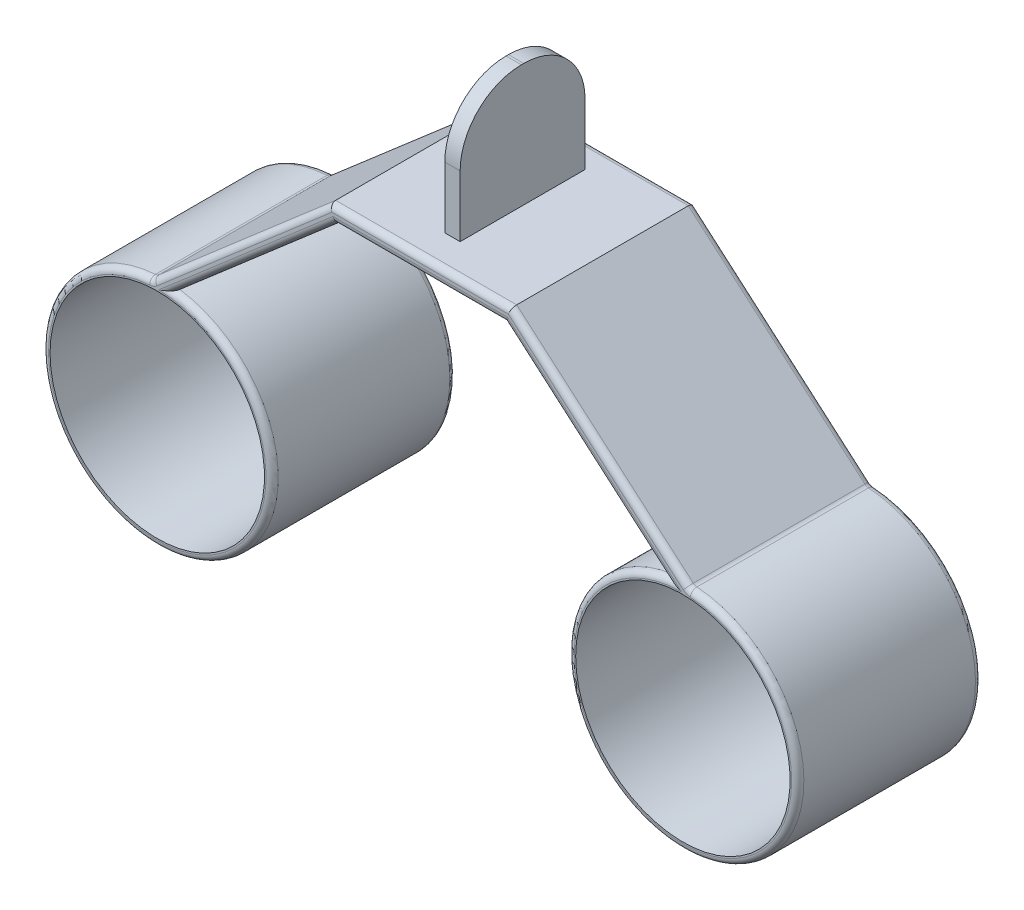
ISO-10303-21;
HEADER;
FILE_DESCRIPTION(('STEP AP214'),'2;1');
FILE_NAME('part.step','',(''),(''),'','','');
FILE_SCHEMA(('AUTOMOTIVE_DESIGN { 1 0 10303 214 1 1 1 1 }'));
ENDSEC;
DATA;
#1=APPLICATION_CONTEXT('core data for automotive mechanical design processes');
#2=APPLICATION_PROTOCOL_DEFINITION('international standard','automotive_design',2000,#1);
#3=PRODUCT_CONTEXT('',#1,'mechanical');
#4=PRODUCT('Part','Part','',(#3));
#5=PRODUCT_RELATED_PRODUCT_CATEGORY('part','',(#4));
#6=PRODUCT_DEFINITION_FORMATION('','',#4);
#7=PRODUCT_DEFINITION_CONTEXT('part definition',#1,'design');
#8=PRODUCT_DEFINITION('design','',#6,#7);
#9=PRODUCT_DEFINITION_SHAPE('','',#8);
#10=(LENGTH_UNIT() NAMED_UNIT(*) SI_UNIT(.MILLI.,.METRE.));
#11=(NAMED_UNIT(*) PLANE_ANGLE_UNIT() SI_UNIT($,.RADIAN.));
#12=(NAMED_UNIT(*) SI_UNIT($,.STERADIAN.) SOLID_ANGLE_UNIT());
#13=UNCERTAINTY_MEASURE_WITH_UNIT(LENGTH_MEASURE(1.E-05),#10,'distance_accuracy_value','');
#14=(GEOMETRIC_REPRESENTATION_CONTEXT(3) GLOBAL_UNCERTAINTY_ASSIGNED_CONTEXT((#13)) GLOBAL_UNIT_ASSIGNED_CONTEXT((#10,
#11,#12)) REPRESENTATION_CONTEXT('',''));
#15=CARTESIAN_POINT('',(0.,0.,0.));
#16=DIRECTION('',(0.,0.,1.));
#17=DIRECTION('',(1.,0.,0.));
#18=AXIS2_PLACEMENT_3D('',#15,#16,#17);
#19=CARTESIAN_POINT('',(37.5204740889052,111.442494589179,0.));
#20=DIRECTION('',(0.,1.,0.));
#21=DIRECTION('',(0.,0.,1.));
#22=AXIS2_PLACEMENT_3D('',#19,#20,#21);
#23=PLANE('',#22);
#24=DIRECTION('',(0.,0.,1.));
#25=VECTOR('',#24,1.);
#26=CARTESIAN_POINT('',(-37.5204740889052,111.442494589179,0.));
#27=LINE('',#26,#25);
#28=CARTESIAN_POINT('',(-37.5204740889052,111.442494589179,2.54));
#29=VERTEX_POINT('',#28);
#30=CARTESIAN_POINT('',(-37.5204740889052,111.442494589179,73.66));
#31=VERTEX_POINT('',#30);
#32=EDGE_CURVE('E246',#29,#31,#27,.T.);
#33=ORIENTED_EDGE('',*,*,#32,.T.);
#34=DIRECTION('',(-1.,0.,0.));
#35=VECTOR('',#34,1.);
#36=CARTESIAN_POINT('',(37.5204740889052,111.442494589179,73.66));
#37=LINE('',#36,#35);
#38=CARTESIAN_POINT('',(37.5204740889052,111.442494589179,73.66));
#39=VERTEX_POINT('',#38);
#40=EDGE_CURVE('E350',#31,#39,#37,.F.);
#41=ORIENTED_EDGE('',*,*,#40,.T.);
#42=DIRECTION('',(0.,0.,1.));
#43=VECTOR('',#42,1.);
#44=CARTESIAN_POINT('',(37.5204740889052,111.442494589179,0.));
#45=LINE('',#44,#43);
#46=CARTESIAN_POINT('',(37.5204740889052,111.442494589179,2.54));
#47=VERTEX_POINT('',#46);
#48=EDGE_CURVE('E249',#47,#39,#45,.T.);
#49=ORIENTED_EDGE('',*,*,#48,.F.);
#50=DIRECTION('',(-1.,0.,0.));
#51=VECTOR('',#50,1.);
#52=CARTESIAN_POINT('',(-37.5204740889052,111.442494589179,2.54));
#53=LINE('',#52,#51);
#54=EDGE_CURVE('E348',#47,#29,#53,.T.);
#55=ORIENTED_EDGE('',*,*,#54,.T.);
#56=EDGE_LOOP('',(#33,#41,#49,#55));
#57=FACE_BOUND('',#56,.T.);
#58=DIRECTION('',(1.,0.,0.));
#59=VECTOR('',#58,1.);
#60=CARTESIAN_POINT('',(3.11952591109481,111.442494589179,62.7233824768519));
#61=LINE('',#60,#59);
#62=CARTESIAN_POINT('',(-3.23047408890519,111.442494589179,62.7233824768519));
#63=VERTEX_POINT('',#62);
#64=CARTESIAN_POINT('',(3.11952591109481,111.442494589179,62.7233824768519));
#65=VERTEX_POINT('',#64);
#66=EDGE_CURVE('E210',#63,#65,#61,.T.);
#67=ORIENTED_EDGE('',*,*,#66,.F.);
#68=DIRECTION('',(0.,0.,1.));
#69=VECTOR('',#68,1.);
#70=CARTESIAN_POINT('',(-3.23047408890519,111.442494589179,62.7233824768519));
#71=LINE('',#70,#69);
#72=CARTESIAN_POINT('',(-3.23047408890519,111.442494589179,10.9366175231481));
#73=VERTEX_POINT('',#72);
#74=EDGE_CURVE('E217',#73,#63,#71,.T.);
#75=ORIENTED_EDGE('',*,*,#74,.F.);
#76=DIRECTION('',(-1.,0.,0.));
#77=VECTOR('',#76,1.);
#78=CARTESIAN_POINT('',(3.11952591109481,111.442494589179,10.9366175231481));
#79=LINE('',#78,#77);
#80=CARTESIAN_POINT('',(3.11952591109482,111.442494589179,10.9366175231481));
#81=VERTEX_POINT('',#80);
#82=EDGE_CURVE('E227',#81,#73,#79,.T.);
#83=ORIENTED_EDGE('',*,*,#82,.F.);
#84=DIRECTION('',(0.,0.,-1.));
#85=VECTOR('',#84,1.);
#86=CARTESIAN_POINT('',(3.11952591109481,111.442494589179,62.7233824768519));
#87=LINE('',#86,#85);
#88=EDGE_CURVE('E225',#65,#81,#87,.T.);
#89=ORIENTED_EDGE('',*,*,#88,.F.);
#90=EDGE_LOOP('',(#67,#75,#83,#89));
#91=FACE_BOUND('',#90,.T.);
#92=ADVANCED_FACE('F35',(#57,#91),#23,.T.);
#93=CARTESIAN_POINT('',(108.9406,0.,76.2));
#94=DIRECTION('',(0.,0.,1.));
#95=DIRECTION('',(1.,0.,0.));
#96=AXIS2_PLACEMENT_3D('',#93,#94,#95);
#97=PLANE('',#96);
#98=DIRECTION('',(1.,0.,0.));
#99=VECTOR('',#98,1.);
#100=CARTESIAN_POINT('',(108.9406,107.632494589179,76.2));
#101=LINE('',#100,#99);
#102=CARTESIAN_POINT('',(-36.1013974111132,107.632494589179,76.2));
#103=VERTEX_POINT('',#102);
#104=CARTESIAN_POINT('',(36.1013974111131,107.632494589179,76.2));
#105=VERTEX_POINT('',#104);
#106=EDGE_CURVE('E317',#103,#105,#101,.T.);
#107=ORIENTED_EDGE('',*,*,#106,.T.);
#108=DIRECTION('',(0.75634683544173,-0.654170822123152,0.));
#109=VECTOR('',#108,1.);
#110=CARTESIAN_POINT('',(131.024239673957,25.5329195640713,76.2));
#111=LINE('',#110,#109);
#112=CARTESIAN_POINT('',(108.421739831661,45.0820142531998,76.2));
#113=VERTEX_POINT('',#112);
#114=EDGE_CURVE('E319',#105,#113,#111,.T.);
#115=ORIENTED_EDGE('',*,*,#114,.T.);
#116=CARTESIAN_POINT('',(108.9406,0.,76.2));
#117=DIRECTION('',(0.,0.,1.));
#118=DIRECTION('',(1.,0.,0.));
#119=AXIS2_PLACEMENT_3D('',#116,#117,#118);
#120=CIRCLE('',#119,45.085);
#121=CARTESIAN_POINT('',(112.039772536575,44.978354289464,76.2));
#122=VERTEX_POINT('',#121);
#123=EDGE_CURVE('E312',#113,#122,#120,.T.);
#124=ORIENTED_EDGE('',*,*,#123,.T.);
#125=CARTESIAN_POINT('',(112.388975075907,50.0463378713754,76.2));
#126=DIRECTION('',(0.,0.,1.));
#127=DIRECTION('',(1.,0.,0.));
#128=AXIS2_PLACEMENT_3D('',#125,#126,#127);
#129=CIRCLE('',#128,5.08);
#130=CARTESIAN_POINT('',(109.065787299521,46.2040959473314,76.2));
#131=VERTEX_POINT('',#130);
#132=EDGE_CURVE('E310',#131,#122,#129,.T.);
#133=ORIENTED_EDGE('',*,*,#132,.F.);
#134=DIRECTION('',(-0.75634683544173,0.654170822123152,0.));
#135=VECTOR('',#134,1.);
#136=CARTESIAN_POINT('',(131.855036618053,26.4934800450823,76.2));
#137=LINE('',#136,#135);
#138=CARTESIAN_POINT('',(36.5744229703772,108.902494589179,76.2));
#139=VERTEX_POINT('',#138);
#140=EDGE_CURVE('E306',#131,#139,#137,.T.);
#141=ORIENTED_EDGE('',*,*,#140,.T.);
#142=DIRECTION('',(-1.,0.,0.));
#143=VECTOR('',#142,1.);
#144=CARTESIAN_POINT('',(108.9406,108.902494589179,76.2));
#145=LINE('',#144,#143);
#146=CARTESIAN_POINT('',(-36.5744229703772,108.902494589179,76.2));
#147=VERTEX_POINT('',#146);
#148=EDGE_CURVE('E304',#139,#147,#145,.T.);
#149=ORIENTED_EDGE('',*,*,#148,.T.);
#150=DIRECTION('',(0.75634683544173,0.654170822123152,0.));
#151=VECTOR('',#150,1.);
#152=CARTESIAN_POINT('',(-109.716288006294,45.6414723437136,76.2));
#153=LINE('',#152,#151);
#154=CARTESIAN_POINT('',(-109.065787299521,46.2040959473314,76.2));
#155=VERTEX_POINT('',#154);
#156=EDGE_CURVE('E302',#147,#155,#153,.F.);
#157=ORIENTED_EDGE('',*,*,#156,.T.);
#158=CARTESIAN_POINT('',(-112.388975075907,50.0463378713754,76.2));
#159=DIRECTION('',(0.,0.,1.));
#160=DIRECTION('',(1.,0.,0.));
#161=AXIS2_PLACEMENT_3D('',#158,#159,#160);
#162=CIRCLE('',#161,5.08);
#163=CARTESIAN_POINT('',(-112.039772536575,44.978354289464,76.2));
#164=VERTEX_POINT('',#163);
#165=EDGE_CURVE('E299',#164,#155,#162,.T.);
#166=ORIENTED_EDGE('',*,*,#165,.F.);
#167=CARTESIAN_POINT('',(-108.9406,0.,76.2));
#168=DIRECTION('',(0.,0.,1.));
#169=DIRECTION('',(1.,0.,0.));
#170=AXIS2_PLACEMENT_3D('',#167,#168,#169);
#171=CIRCLE('',#170,45.085);
#172=CARTESIAN_POINT('',(-108.421739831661,45.0820142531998,76.2));
#173=VERTEX_POINT('',#172);
#174=EDGE_CURVE('E308',#164,#173,#171,.T.);
#175=ORIENTED_EDGE('',*,*,#174,.T.);
#176=DIRECTION('',(-0.75634683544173,-0.654170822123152,0.));
#177=VECTOR('',#176,1.);
#178=CARTESIAN_POINT('',(-36.816940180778,107.013615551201,76.2));
#179=LINE('',#178,#177);
#180=EDGE_CURVE('E315',#173,#103,#179,.F.);
#181=ORIENTED_EDGE('',*,*,#180,.T.);
#182=EDGE_LOOP('',(#107,#115,#124,#133,#141,#149,#157,#166,#175,#181));
#183=FACE_BOUND('',#182,.T.);
#184=CARTESIAN_POINT('',(108.9406,0.,76.2));
#185=DIRECTION('',(0.,0.,1.));
#186=DIRECTION('',(1.,0.,0.));
#187=AXIS2_PLACEMENT_3D('',#184,#185,#186);
#188=CIRCLE('',#187,44.45);
#189=CARTESIAN_POINT('',(64.4906,0.,76.2));
#190=VERTEX_POINT('',#189);
#191=EDGE_CURVE('E264',#190,#190,#188,.T.);
#192=ORIENTED_EDGE('',*,*,#191,.F.);
#193=EDGE_LOOP('',(#192));
#194=FACE_BOUND('',#193,.T.);
#195=CARTESIAN_POINT('',(-108.9406,0.,76.2));
#196=DIRECTION('',(0.,0.,-1.));
#197=DIRECTION('',(-1.,0.,0.));
#198=AXIS2_PLACEMENT_3D('',#195,#196,#197);
#199=CIRCLE('',#198,44.45);
#200=CARTESIAN_POINT('',(-153.3906,0.,76.2));
#201=VERTEX_POINT('',#200);
#202=EDGE_CURVE('E238',#201,#201,#199,.T.);
#203=ORIENTED_EDGE('',*,*,#202,.T.);
#204=EDGE_LOOP('',(#203));
#205=FACE_BOUND('',#204,.T.);
#206=ADVANCED_FACE('F522',(#183,#194,#205),#97,.T.);
#207=CARTESIAN_POINT('',(108.9406,0.,0.));
#208=DIRECTION('',(0.,0.,1.));
#209=DIRECTION('',(1.,0.,0.));
#210=AXIS2_PLACEMENT_3D('',#207,#208,#209);
#211=PLANE('',#210);
#212=DIRECTION('',(1.,0.,0.));
#213=VECTOR('',#212,1.);
#214=CARTESIAN_POINT('',(-35.1553462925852,107.632494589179,0.));
#215=LINE('',#214,#213);
#216=CARTESIAN_POINT('',(36.1013974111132,107.632494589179,0.));
#217=VERTEX_POINT('',#216);
#218=CARTESIAN_POINT('',(-36.1013974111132,107.632494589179,0.));
#219=VERTEX_POINT('',#218);
#220=EDGE_CURVE('E295',#217,#219,#215,.F.);
#221=ORIENTED_EDGE('',*,*,#220,.T.);
#222=DIRECTION('',(-0.75634683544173,-0.654170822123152,0.));
#223=VECTOR('',#222,1.);
#224=CARTESIAN_POINT('',(-6.38300373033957,133.336186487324,0.));
#225=LINE('',#224,#223);
#226=CARTESIAN_POINT('',(-108.421739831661,45.0820142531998,0.));
#227=VERTEX_POINT('',#226);
#228=EDGE_CURVE('E297',#219,#227,#225,.T.);
#229=ORIENTED_EDGE('',*,*,#228,.T.);
#230=CARTESIAN_POINT('',(-108.9406,0.,0.));
#231=DIRECTION('',(0.,0.,1.));
#232=DIRECTION('',(1.,0.,0.));
#233=AXIS2_PLACEMENT_3D('',#230,#231,#232);
#234=CIRCLE('',#233,45.085);
#235=CARTESIAN_POINT('',(-112.039772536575,44.978354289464,0.));
#236=VERTEX_POINT('',#235);
#237=EDGE_CURVE('E288',#227,#236,#234,.F.);
#238=ORIENTED_EDGE('',*,*,#237,.T.);
#239=CARTESIAN_POINT('',(-112.388975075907,50.0463378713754,0.));
#240=DIRECTION('',(0.,0.,1.));
#241=DIRECTION('',(1.,0.,0.));
#242=AXIS2_PLACEMENT_3D('',#239,#240,#241);
#243=CIRCLE('',#242,5.08);
#244=CARTESIAN_POINT('',(-109.065787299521,46.2040959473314,0.));
#245=VERTEX_POINT('',#244);
#246=EDGE_CURVE('E285',#245,#236,#243,.F.);
#247=ORIENTED_EDGE('',*,*,#246,.F.);
#248=DIRECTION('',(0.75634683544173,0.654170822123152,0.));
#249=VECTOR('',#248,1.);
#250=CARTESIAN_POINT('',(-7.21380067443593,134.296746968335,0.));
#251=LINE('',#250,#249);
#252=CARTESIAN_POINT('',(-36.5744229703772,108.902494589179,0.));
#253=VERTEX_POINT('',#252);
#254=EDGE_CURVE('E283',#245,#253,#251,.T.);
#255=ORIENTED_EDGE('',*,*,#254,.T.);
#256=DIRECTION('',(-1.,0.,0.));
#257=VECTOR('',#256,1.);
#258=CARTESIAN_POINT('',(37.5204740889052,108.902494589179,0.));
#259=LINE('',#258,#257);
#260=CARTESIAN_POINT('',(36.5744229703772,108.902494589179,0.));
#261=VERTEX_POINT('',#260);
#262=EDGE_CURVE('E281',#253,#261,#259,.F.);
#263=ORIENTED_EDGE('',*,*,#262,.T.);
#264=DIRECTION('',(-0.75634683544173,0.654170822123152,0.));
#265=VECTOR('',#264,1.);
#266=CARTESIAN_POINT('',(109.716288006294,45.6414723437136,0.));
#267=LINE('',#266,#265);
#268=CARTESIAN_POINT('',(109.065787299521,46.2040959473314,0.));
#269=VERTEX_POINT('',#268);
#270=EDGE_CURVE('E279',#261,#269,#267,.F.);
#271=ORIENTED_EDGE('',*,*,#270,.T.);
#272=CARTESIAN_POINT('',(112.388975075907,50.0463378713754,0.));
#273=DIRECTION('',(0.,0.,1.));
#274=DIRECTION('',(1.,0.,0.));
#275=AXIS2_PLACEMENT_3D('',#272,#273,#274);
#276=CIRCLE('',#275,5.08);
#277=CARTESIAN_POINT('',(112.039772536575,44.978354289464,0.));
#278=VERTEX_POINT('',#277);
#279=EDGE_CURVE('E276',#278,#269,#276,.F.);
#280=ORIENTED_EDGE('',*,*,#279,.F.);
#281=CARTESIAN_POINT('',(108.9406,0.,0.));
#282=DIRECTION('',(0.,0.,1.));
#283=DIRECTION('',(1.,0.,0.));
#284=AXIS2_PLACEMENT_3D('',#281,#282,#283);
#285=CIRCLE('',#284,45.085);
#286=CARTESIAN_POINT('',(108.421739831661,45.0820142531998,0.));
#287=VERTEX_POINT('',#286);
#288=EDGE_CURVE('E290',#278,#287,#285,.F.);
#289=ORIENTED_EDGE('',*,*,#288,.T.);
#290=DIRECTION('',(0.75634683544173,-0.654170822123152,0.));
#291=VECTOR('',#290,1.);
#292=CARTESIAN_POINT('',(36.816940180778,107.013615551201,0.));
#293=LINE('',#292,#291);
#294=EDGE_CURVE('E293',#287,#217,#293,.F.);
#295=ORIENTED_EDGE('',*,*,#294,.T.);
#296=EDGE_LOOP('',(#221,#229,#238,#247,#255,#263,#271,#280,#289,#295));
#297=FACE_BOUND('',#296,.T.);
#298=CARTESIAN_POINT('',(108.9406,0.,0.));
#299=DIRECTION('',(0.,0.,1.));
#300=DIRECTION('',(1.,0.,0.));
#301=AXIS2_PLACEMENT_3D('',#298,#299,#300);
#302=CIRCLE('',#301,44.45);
#303=CARTESIAN_POINT('',(64.4906,0.,0.));
#304=VERTEX_POINT('',#303);
#305=EDGE_CURVE('E258',#304,#304,#302,.T.);
#306=ORIENTED_EDGE('',*,*,#305,.T.);
#307=EDGE_LOOP('',(#306));
#308=FACE_BOUND('',#307,.T.);
#309=CARTESIAN_POINT('',(-108.9406,0.,0.));
#310=DIRECTION('',(0.,0.,-1.));
#311=DIRECTION('',(-1.,0.,0.));
#312=AXIS2_PLACEMENT_3D('',#309,#310,#311);
#313=CIRCLE('',#312,44.45);
#314=CARTESIAN_POINT('',(-153.3906,0.,0.));
#315=VERTEX_POINT('',#314);
#316=EDGE_CURVE('E242',#315,#315,#313,.T.);
#317=ORIENTED_EDGE('',*,*,#316,.F.);
#318=EDGE_LOOP('',(#317));
#319=FACE_BOUND('',#318,.T.);
#320=ADVANCED_FACE('F528',(#297,#308,#319),#211,.F.);
#321=CARTESIAN_POINT('',(108.9406,0.,76.2));
#322=DIRECTION('',(0.,0.,-1.));
#323=DIRECTION('',(-1.,0.,0.));
#324=AXIS2_PLACEMENT_3D('',#321,#322,#323);
#325=CYLINDRICAL_SURFACE('',#324,47.625);
#326=DIRECTION('',(0.,0.,1.));
#327=VECTOR('',#326,1.);
#328=CARTESIAN_POINT('',(102.159765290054,47.1398017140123,0.));
#329=LINE('',#328,#327);
#330=CARTESIAN_POINT('',(102.159765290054,47.1398017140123,2.54));
#331=VERTEX_POINT('',#330);
#332=CARTESIAN_POINT('',(102.159765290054,47.1398017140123,73.66));
#333=VERTEX_POINT('',#332);
#334=EDGE_CURVE('E255',#331,#333,#329,.T.);
#335=ORIENTED_EDGE('',*,*,#334,.F.);
#336=CARTESIAN_POINT('',(108.9406,0.,2.54));
#337=DIRECTION('',(0.,0.,1.));
#338=DIRECTION('',(1.,0.,0.));
#339=AXIS2_PLACEMENT_3D('',#336,#337,#338);
#340=CIRCLE('',#339,47.625);
#341=CARTESIAN_POINT('',(112.214373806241,47.5123460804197,2.54));
#342=VERTEX_POINT('',#341);
#343=EDGE_CURVE('E273',#331,#342,#340,.T.);
#344=ORIENTED_EDGE('',*,*,#343,.T.);
#345=DIRECTION('',(0.,0.,-1.));
#346=VECTOR('',#345,1.);
#347=CARTESIAN_POINT('',(112.214373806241,47.5123460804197,76.2));
#348=LINE('',#347,#346);
#349=CARTESIAN_POINT('',(112.214373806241,47.5123460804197,73.66));
#350=VERTEX_POINT('',#349);
#351=EDGE_CURVE('E267',#342,#350,#348,.F.);
#352=ORIENTED_EDGE('',*,*,#351,.T.);
#353=CARTESIAN_POINT('',(108.9406,0.,73.66));
#354=DIRECTION('',(0.,0.,1.));
#355=DIRECTION('',(1.,0.,0.));
#356=AXIS2_PLACEMENT_3D('',#353,#354,#355);
#357=CIRCLE('',#356,47.625);
#358=EDGE_CURVE('E271',#350,#333,#357,.F.);
#359=ORIENTED_EDGE('',*,*,#358,.T.);
#360=EDGE_LOOP('',(#335,#344,#352,#359));
#361=FACE_BOUND('',#360,.T.);
#362=ADVANCED_FACE('F543',(#361),#325,.T.);
#363=CARTESIAN_POINT('',(108.9406,0.,76.2));
#364=DIRECTION('',(0.,0.,-1.));
#365=DIRECTION('',(-1.,0.,0.));
#366=AXIS2_PLACEMENT_3D('',#363,#364,#365);
#367=CYLINDRICAL_SURFACE('',#366,44.45);
#368=CARTESIAN_POINT('',(64.4906,0.,76.2));
#369=CARTESIAN_POINT('',(64.4906,0.,75.40625));
#370=CARTESIAN_POINT('',(64.4906,0.,74.6125));
#371=CARTESIAN_POINT('',(64.4906,0.,73.025));
#372=CARTESIAN_POINT('',(64.4906,0.,72.23125));
#373=CARTESIAN_POINT('',(64.4906,0.,70.64375));
#374=CARTESIAN_POINT('',(64.4906,0.,69.85));
#375=CARTESIAN_POINT('',(64.4906,0.,68.2625));
#376=CARTESIAN_POINT('',(64.4906,0.,67.46875));
#377=CARTESIAN_POINT('',(64.4906,0.,65.88125));
#378=CARTESIAN_POINT('',(64.4906,0.,65.0875));
#379=CARTESIAN_POINT('',(64.4906,0.,63.5));
#380=CARTESIAN_POINT('',(64.4906,0.,62.70625));
#381=CARTESIAN_POINT('',(64.4906,0.,61.11875));
#382=CARTESIAN_POINT('',(64.4906,0.,60.325));
#383=CARTESIAN_POINT('',(64.4906,0.,58.7375));
#384=CARTESIAN_POINT('',(64.4906,0.,57.94375));
#385=CARTESIAN_POINT('',(64.4906,0.,56.35625));
#386=CARTESIAN_POINT('',(64.4906,0.,55.5625));
#387=CARTESIAN_POINT('',(64.4906,0.,53.975));
#388=CARTESIAN_POINT('',(64.4906,0.,53.18125));
#389=CARTESIAN_POINT('',(64.4906,0.,51.59375));
#390=CARTESIAN_POINT('',(64.4906,0.,50.8));
#391=CARTESIAN_POINT('',(64.4906,0.,49.2125));
#392=CARTESIAN_POINT('',(64.4906,0.,48.41875));
#393=CARTESIAN_POINT('',(64.4906,0.,46.83125));
#394=CARTESIAN_POINT('',(64.4906,0.,46.0375));
#395=CARTESIAN_POINT('',(64.4906,0.,44.45));
#396=CARTESIAN_POINT('',(64.4906,0.,43.65625));
#397=CARTESIAN_POINT('',(64.4906,0.,42.06875));
#398=CARTESIAN_POINT('',(64.4906,0.,41.275));
#399=CARTESIAN_POINT('',(64.4906,0.,39.6875));
#400=CARTESIAN_POINT('',(64.4906,0.,38.89375));
#401=CARTESIAN_POINT('',(64.4906,0.,37.30625));
#402=CARTESIAN_POINT('',(64.4906,0.,36.5125));
#403=CARTESIAN_POINT('',(64.4906,0.,34.925));
#404=CARTESIAN_POINT('',(64.4906,0.,34.13125));
#405=CARTESIAN_POINT('',(64.4906,0.,32.54375));
#406=CARTESIAN_POINT('',(64.4906,0.,31.75));
#407=CARTESIAN_POINT('',(64.4906,0.,30.1625));
#408=CARTESIAN_POINT('',(64.4906,0.,29.36875));
#409=CARTESIAN_POINT('',(64.4906,0.,27.78125));
#410=CARTESIAN_POINT('',(64.4906,0.,26.9875));
#411=CARTESIAN_POINT('',(64.4906,0.,25.4));
#412=CARTESIAN_POINT('',(64.4906,0.,24.60625));
#413=CARTESIAN_POINT('',(64.4906,0.,23.01875));
#414=CARTESIAN_POINT('',(64.4906,0.,22.225));
#415=CARTESIAN_POINT('',(64.4906,0.,20.6375));
#416=CARTESIAN_POINT('',(64.4906,0.,19.84375));
#417=CARTESIAN_POINT('',(64.4906,0.,18.25625));
#418=CARTESIAN_POINT('',(64.4906,0.,17.4625));
#419=CARTESIAN_POINT('',(64.4906,0.,15.875));
#420=CARTESIAN_POINT('',(64.4906,0.,15.08125));
#421=CARTESIAN_POINT('',(64.4906,0.,13.49375));
#422=CARTESIAN_POINT('',(64.4906,0.,12.7));
#423=CARTESIAN_POINT('',(64.4906,0.,11.1125));
#424=CARTESIAN_POINT('',(64.4906,0.,10.31875));
#425=CARTESIAN_POINT('',(64.4906,0.,8.73125));
#426=CARTESIAN_POINT('',(64.4906,0.,7.93750000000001));
#427=CARTESIAN_POINT('',(64.4906,0.,6.35));
#428=CARTESIAN_POINT('',(64.4906,0.,5.55625));
#429=CARTESIAN_POINT('',(64.4906,0.,3.96875));
#430=CARTESIAN_POINT('',(64.4906,0.,3.175));
#431=CARTESIAN_POINT('',(64.4906,0.,1.5875));
#432=CARTESIAN_POINT('',(64.4906,0.,0.793750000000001));
#433=CARTESIAN_POINT('',(64.4906,0.,0.));
#434=B_SPLINE_CURVE_WITH_KNOTS('',3,(#368,#369,#370,#371,#372,#373,#374,#375,#376,#377,#378,
#379,#380,#381,#382,#383,#384,#385,#386,#387,#388,#389,#390,#391,#392,#393,#394,#395,#396,#397,
#398,#399,#400,#401,#402,#403,#404,#405,#406,#407,#408,#409,#410,#411,#412,#413,#414,#415,#416,
#417,#418,#419,#420,#421,#422,#423,#424,#425,#426,#427,#428,#429,#430,#431,#432,#433),
.UNSPECIFIED.,.F.,.F.,(4,2,2,2,2,2,2,2,2,2,2,2,2,2,2,2,2,2,2,2,2,2,2,2,2,2,2,2,2,2,2,2,4),(0.,
2.38125,4.7625,7.14375,9.52500000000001,11.90625,14.2875,16.66875,19.05,21.43125,23.8125,
26.19375,28.575,30.95625,33.3375,35.71875,38.1,40.48125,42.8625,45.24375,47.625,50.00625,
52.3875,54.76875,57.15,59.53125,61.9125,64.29375,66.675,69.05625,71.4375,73.81875,76.2),.UNSPECIFIED.);
#435=EDGE_CURVE('BSEAM540',#190,#304,#434,.T.);
#436=ORIENTED_EDGE('',*,*,#191,.T.);
#437=ORIENTED_EDGE('',*,*,#305,.F.);
#438=ORIENTED_EDGE('',*,*,#435,.T.);
#439=ORIENTED_EDGE('',*,*,#435,.F.);
#440=EDGE_LOOP('',(#436,#438,#437,#439));
#441=FACE_BOUND('',#440,.T.);
#442=ADVANCED_FACE('F540',(#441),#367,.F.);
#443=CARTESIAN_POINT('',(35.1553462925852,105.092494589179,0.));
#444=DIRECTION('',(-0.654170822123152,-0.75634683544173,0.));
#445=DIRECTION('',(0.75634683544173,-0.654170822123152,0.));
#446=AXIS2_PLACEMENT_3D('',#443,#444,#445);
#447=PLANE('',#446);
#448=ORIENTED_EDGE('',*,*,#334,.T.);
#449=DIRECTION('',(0.75634683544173,-0.654170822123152,0.));
#450=VECTOR('',#449,1.);
#451=CARTESIAN_POINT('',(35.1553462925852,105.092494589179,73.66));
#452=LINE('',#451,#450);
#453=CARTESIAN_POINT('',(35.1553462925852,105.092494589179,73.66));
#454=VERTEX_POINT('',#453);
#455=EDGE_CURVE('E342',#333,#454,#452,.F.);
#456=ORIENTED_EDGE('',*,*,#455,.T.);
#457=DIRECTION('',(0.,0.,1.));
#458=VECTOR('',#457,1.);
#459=CARTESIAN_POINT('',(35.1553462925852,105.092494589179,0.));
#460=LINE('',#459,#458);
#461=CARTESIAN_POINT('',(35.1553462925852,105.092494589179,2.54));
#462=VERTEX_POINT('',#461);
#463=EDGE_CURVE('E259',#462,#454,#460,.T.);
#464=ORIENTED_EDGE('',*,*,#463,.F.);
#465=DIRECTION('',(0.75634683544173,-0.654170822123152,0.));
#466=VECTOR('',#465,1.);
#467=CARTESIAN_POINT('',(102.159765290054,47.1398017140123,2.54));
#468=LINE('',#467,#466);
#469=EDGE_CURVE('E340',#462,#331,#468,.T.);
#470=ORIENTED_EDGE('',*,*,#469,.T.);
#471=EDGE_LOOP('',(#448,#456,#464,#470));
#472=FACE_BOUND('',#471,.T.);
#473=ADVANCED_FACE('F542',(#472),#447,.T.);
#474=CARTESIAN_POINT('',(0.,105.092494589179,0.));
#475=DIRECTION('',(0.,-1.,0.));
#476=DIRECTION('',(0.,0.,-1.));
#477=AXIS2_PLACEMENT_3D('',#474,#475,#476);
#478=PLANE('',#477);
#479=ORIENTED_EDGE('',*,*,#463,.T.);
#480=DIRECTION('',(1.,0.,0.));
#481=VECTOR('',#480,1.);
#482=CARTESIAN_POINT('',(0.,105.092494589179,73.66));
#483=LINE('',#482,#481);
#484=CARTESIAN_POINT('',(-35.1553462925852,105.092494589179,73.66));
#485=VERTEX_POINT('',#484);
#486=EDGE_CURVE('E346',#454,#485,#483,.F.);
#487=ORIENTED_EDGE('',*,*,#486,.T.);
#488=DIRECTION('',(0.,0.,1.));
#489=VECTOR('',#488,1.);
#490=CARTESIAN_POINT('',(-35.1553462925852,105.092494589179,0.));
#491=LINE('',#490,#489);
#492=CARTESIAN_POINT('',(-35.1553462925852,105.092494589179,2.54));
#493=VERTEX_POINT('',#492);
#494=EDGE_CURVE('E250',#493,#485,#491,.T.);
#495=ORIENTED_EDGE('',*,*,#494,.F.);
#496=DIRECTION('',(1.,0.,0.));
#497=VECTOR('',#496,1.);
#498=CARTESIAN_POINT('',(35.1553462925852,105.092494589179,2.54));
#499=LINE('',#498,#497);
#500=EDGE_CURVE('E344',#493,#462,#499,.T.);
#501=ORIENTED_EDGE('',*,*,#500,.T.);
#502=EDGE_LOOP('',(#479,#487,#495,#501));
#503=FACE_BOUND('',#502,.T.);
#504=ADVANCED_FACE('F533',(#503),#478,.T.);
#505=CARTESIAN_POINT('',(111.377881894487,47.5625933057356,0.));
#506=DIRECTION('',(0.654170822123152,0.75634683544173,0.));
#507=DIRECTION('',(-0.75634683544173,0.654170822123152,0.));
#508=AXIS2_PLACEMENT_3D('',#505,#506,#507);
#509=PLANE('',#508);
#510=ORIENTED_EDGE('',*,*,#48,.T.);
#511=DIRECTION('',(-0.75634683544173,0.654170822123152,0.));
#512=VECTOR('',#511,1.);
#513=CARTESIAN_POINT('',(111.377881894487,47.5625933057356,73.66));
#514=LINE('',#513,#512);
#515=CARTESIAN_POINT('',(110.727381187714,48.1252169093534,73.66));
#516=VERTEX_POINT('',#515);
#517=EDGE_CURVE('E332',#39,#516,#514,.F.);
#518=ORIENTED_EDGE('',*,*,#517,.T.);
#519=DIRECTION('',(0.,0.,-1.));
#520=VECTOR('',#519,1.);
#521=CARTESIAN_POINT('',(110.727381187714,48.1252169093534,0.));
#522=LINE('',#521,#520);
#523=CARTESIAN_POINT('',(110.727381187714,48.1252169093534,2.54));
#524=VERTEX_POINT('',#523);
#525=EDGE_CURVE('E329',#516,#524,#522,.T.);
#526=ORIENTED_EDGE('',*,*,#525,.T.);
#527=DIRECTION('',(-0.75634683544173,0.654170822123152,0.));
#528=VECTOR('',#527,1.);
#529=CARTESIAN_POINT('',(37.5204740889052,111.442494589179,2.54));
#530=LINE('',#529,#528);
#531=EDGE_CURVE('E327',#524,#47,#530,.T.);
#532=ORIENTED_EDGE('',*,*,#531,.T.);
#533=EDGE_LOOP('',(#510,#518,#526,#532));
#534=FACE_BOUND('',#533,.T.);
#535=ADVANCED_FACE('F535',(#534),#509,.T.);
#536=CARTESIAN_POINT('',(-111.377881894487,47.5625933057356,0.));
#537=DIRECTION('',(0.654170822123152,-0.75634683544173,0.));
#538=DIRECTION('',(0.75634683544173,0.654170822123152,0.));
#539=AXIS2_PLACEMENT_3D('',#536,#537,#538);
#540=PLANE('',#539);
#541=DIRECTION('',(0.,0.,-1.));
#542=VECTOR('',#541,1.);
#543=CARTESIAN_POINT('',(-110.727381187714,48.1252169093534,0.));
#544=LINE('',#543,#542);
#545=CARTESIAN_POINT('',(-110.727381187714,48.1252169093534,2.54));
#546=VERTEX_POINT('',#545);
#547=CARTESIAN_POINT('',(-110.727381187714,48.1252169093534,73.66));
#548=VERTEX_POINT('',#547);
#549=EDGE_CURVE('E336',#546,#548,#544,.F.);
#550=ORIENTED_EDGE('',*,*,#549,.T.);
#551=DIRECTION('',(0.75634683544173,0.654170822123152,0.));
#552=VECTOR('',#551,1.);
#553=CARTESIAN_POINT('',(-37.5204740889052,111.442494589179,73.66));
#554=LINE('',#553,#552);
#555=EDGE_CURVE('E338',#548,#31,#554,.T.);
#556=ORIENTED_EDGE('',*,*,#555,.T.);
#557=ORIENTED_EDGE('',*,*,#32,.F.);
#558=DIRECTION('',(0.75634683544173,0.654170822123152,0.));
#559=VECTOR('',#558,1.);
#560=CARTESIAN_POINT('',(-111.377881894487,47.5625933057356,2.54));
#561=LINE('',#560,#559);
#562=EDGE_CURVE('E334',#29,#546,#561,.F.);
#563=ORIENTED_EDGE('',*,*,#562,.T.);
#564=EDGE_LOOP('',(#550,#556,#557,#563));
#565=FACE_BOUND('',#564,.T.);
#566=ADVANCED_FACE('F538',(#565),#540,.F.);
#567=CARTESIAN_POINT('',(-35.1553462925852,105.092494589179,0.));
#568=DIRECTION('',(-0.654170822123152,0.75634683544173,0.));
#569=DIRECTION('',(-0.75634683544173,-0.654170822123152,0.));
#570=AXIS2_PLACEMENT_3D('',#567,#568,#569);
#571=PLANE('',#570);
#572=ORIENTED_EDGE('',*,*,#494,.T.);
#573=DIRECTION('',(-0.75634683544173,-0.654170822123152,0.));
#574=VECTOR('',#573,1.);
#575=CARTESIAN_POINT('',(-102.159765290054,47.1398017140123,73.66));
#576=LINE('',#575,#574);
#577=CARTESIAN_POINT('',(-102.159765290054,47.1398017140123,73.66));
#578=VERTEX_POINT('',#577);
#579=EDGE_CURVE('E354',#485,#578,#576,.T.);
#580=ORIENTED_EDGE('',*,*,#579,.T.);
#581=DIRECTION('',(0.,0.,1.));
#582=VECTOR('',#581,1.);
#583=CARTESIAN_POINT('',(-102.159765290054,47.1398017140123,0.));
#584=LINE('',#583,#582);
#585=CARTESIAN_POINT('',(-102.159765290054,47.1398017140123,2.54));
#586=VERTEX_POINT('',#585);
#587=EDGE_CURVE('E241',#586,#578,#584,.T.);
#588=ORIENTED_EDGE('',*,*,#587,.F.);
#589=DIRECTION('',(-0.75634683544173,-0.654170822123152,0.));
#590=VECTOR('',#589,1.);
#591=CARTESIAN_POINT('',(-35.1553462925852,105.092494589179,2.54));
#592=LINE('',#591,#590);
#593=EDGE_CURVE('E352',#586,#493,#592,.F.);
#594=ORIENTED_EDGE('',*,*,#593,.T.);
#595=EDGE_LOOP('',(#572,#580,#588,#594));
#596=FACE_BOUND('',#595,.T.);
#597=ADVANCED_FACE('F666',(#596),#571,.F.);
#598=CARTESIAN_POINT('',(-108.9406,0.,76.2));
#599=DIRECTION('',(0.,0.,-1.));
#600=DIRECTION('',(-1.,0.,0.));
#601=AXIS2_PLACEMENT_3D('',#598,#599,#600);
#602=CYLINDRICAL_SURFACE('',#601,47.625);
#603=DIRECTION('',(0.,0.,-1.));
#604=VECTOR('',#603,1.);
#605=CARTESIAN_POINT('',(-112.214373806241,47.5123460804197,76.2));
#606=LINE('',#605,#604);
#607=CARTESIAN_POINT('',(-112.214373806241,47.5123460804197,73.66));
#608=VERTEX_POINT('',#607);
#609=CARTESIAN_POINT('',(-112.214373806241,47.5123460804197,2.54));
#610=VERTEX_POINT('',#609);
#611=EDGE_CURVE('E321',#608,#610,#606,.T.);
#612=ORIENTED_EDGE('',*,*,#611,.T.);
#613=CARTESIAN_POINT('',(-108.9406,0.,2.54));
#614=DIRECTION('',(0.,0.,1.));
#615=DIRECTION('',(1.,0.,0.));
#616=AXIS2_PLACEMENT_3D('',#613,#614,#615);
#617=CIRCLE('',#616,47.625);
#618=EDGE_CURVE('E325',#610,#586,#617,.T.);
#619=ORIENTED_EDGE('',*,*,#618,.T.);
#620=ORIENTED_EDGE('',*,*,#587,.T.);
#621=CARTESIAN_POINT('',(-108.9406,0.,73.66));
#622=DIRECTION('',(0.,0.,1.));
#623=DIRECTION('',(1.,0.,0.));
#624=AXIS2_PLACEMENT_3D('',#621,#622,#623);
#625=CIRCLE('',#624,47.625);
#626=EDGE_CURVE('E323',#578,#608,#625,.F.);
#627=ORIENTED_EDGE('',*,*,#626,.T.);
#628=EDGE_LOOP('',(#612,#619,#620,#627));
#629=FACE_BOUND('',#628,.T.);
#630=ADVANCED_FACE('F663',(#629),#602,.T.);
#631=CARTESIAN_POINT('',(-108.9406,0.,76.2));
#632=DIRECTION('',(0.,0.,-1.));
#633=DIRECTION('',(-1.,0.,0.));
#634=AXIS2_PLACEMENT_3D('',#631,#632,#633);
#635=CYLINDRICAL_SURFACE('',#634,44.45);
#636=CARTESIAN_POINT('',(-153.3906,0.,76.2));
#637=CARTESIAN_POINT('',(-153.3906,0.,75.40625));
#638=CARTESIAN_POINT('',(-153.3906,0.,74.6125));
#639=CARTESIAN_POINT('',(-153.3906,0.,73.025));
#640=CARTESIAN_POINT('',(-153.3906,0.,72.23125));
#641=CARTESIAN_POINT('',(-153.3906,0.,70.64375));
#642=CARTESIAN_POINT('',(-153.3906,0.,69.85));
#643=CARTESIAN_POINT('',(-153.3906,0.,68.2625));
#644=CARTESIAN_POINT('',(-153.3906,0.,67.46875));
#645=CARTESIAN_POINT('',(-153.3906,0.,65.88125));
#646=CARTESIAN_POINT('',(-153.3906,0.,65.0875));
#647=CARTESIAN_POINT('',(-153.3906,0.,63.5));
#648=CARTESIAN_POINT('',(-153.3906,0.,62.70625));
#649=CARTESIAN_POINT('',(-153.3906,0.,61.11875));
#650=CARTESIAN_POINT('',(-153.3906,0.,60.325));
#651=CARTESIAN_POINT('',(-153.3906,0.,58.7375));
#652=CARTESIAN_POINT('',(-153.3906,0.,57.94375));
#653=CARTESIAN_POINT('',(-153.3906,0.,56.35625));
#654=CARTESIAN_POINT('',(-153.3906,0.,55.5625));
#655=CARTESIAN_POINT('',(-153.3906,0.,53.975));
#656=CARTESIAN_POINT('',(-153.3906,0.,53.18125));
#657=CARTESIAN_POINT('',(-153.3906,0.,51.59375));
#658=CARTESIAN_POINT('',(-153.3906,0.,50.8));
#659=CARTESIAN_POINT('',(-153.3906,0.,49.2125));
#660=CARTESIAN_POINT('',(-153.3906,0.,48.41875));
#661=CARTESIAN_POINT('',(-153.3906,0.,46.83125));
#662=CARTESIAN_POINT('',(-153.3906,0.,46.0375));
#663=CARTESIAN_POINT('',(-153.3906,0.,44.45));
#664=CARTESIAN_POINT('',(-153.3906,0.,43.65625));
#665=CARTESIAN_POINT('',(-153.3906,0.,42.06875));
#666=CARTESIAN_POINT('',(-153.3906,0.,41.275));
#667=CARTESIAN_POINT('',(-153.3906,0.,39.6875));
#668=CARTESIAN_POINT('',(-153.3906,0.,38.89375));
#669=CARTESIAN_POINT('',(-153.3906,0.,37.30625));
#670=CARTESIAN_POINT('',(-153.3906,0.,36.5125));
#671=CARTESIAN_POINT('',(-153.3906,0.,34.925));
#672=CARTESIAN_POINT('',(-153.3906,0.,34.13125));
#673=CARTESIAN_POINT('',(-153.3906,0.,32.54375));
#674=CARTESIAN_POINT('',(-153.3906,0.,31.75));
#675=CARTESIAN_POINT('',(-153.3906,0.,30.1625));
#676=CARTESIAN_POINT('',(-153.3906,0.,29.36875));
#677=CARTESIAN_POINT('',(-153.3906,0.,27.78125));
#678=CARTESIAN_POINT('',(-153.3906,0.,26.9875));
#679=CARTESIAN_POINT('',(-153.3906,0.,25.4));
#680=CARTESIAN_POINT('',(-153.3906,0.,24.60625));
#681=CARTESIAN_POINT('',(-153.3906,0.,23.01875));
#682=CARTESIAN_POINT('',(-153.3906,0.,22.225));
#683=CARTESIAN_POINT('',(-153.3906,0.,20.6375));
#684=CARTESIAN_POINT('',(-153.3906,0.,19.84375));
#685=CARTESIAN_POINT('',(-153.3906,0.,18.25625));
#686=CARTESIAN_POINT('',(-153.3906,0.,17.4625));
#687=CARTESIAN_POINT('',(-153.3906,0.,15.875));
#688=CARTESIAN_POINT('',(-153.3906,0.,15.08125));
#689=CARTESIAN_POINT('',(-153.3906,0.,13.49375));
#690=CARTESIAN_POINT('',(-153.3906,0.,12.7));
#691=CARTESIAN_POINT('',(-153.3906,0.,11.1125));
#692=CARTESIAN_POINT('',(-153.3906,0.,10.31875));
#693=CARTESIAN_POINT('',(-153.3906,0.,8.73125));
#694=CARTESIAN_POINT('',(-153.3906,0.,7.93750000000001));
#695=CARTESIAN_POINT('',(-153.3906,0.,6.35));
#696=CARTESIAN_POINT('',(-153.3906,0.,5.55625));
#697=CARTESIAN_POINT('',(-153.3906,0.,3.96875));
#698=CARTESIAN_POINT('',(-153.3906,0.,3.175));
#699=CARTESIAN_POINT('',(-153.3906,0.,1.5875));
#700=CARTESIAN_POINT('',(-153.3906,0.,0.793750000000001));
#701=CARTESIAN_POINT('',(-153.3906,0.,0.));
#702=B_SPLINE_CURVE_WITH_KNOTS('',3,(#636,#637,#638,#639,#640,#641,#642,#643,#644,#645,#646,
#647,#648,#649,#650,#651,#652,#653,#654,#655,#656,#657,#658,#659,#660,#661,#662,#663,#664,#665,
#666,#667,#668,#669,#670,#671,#672,#673,#674,#675,#676,#677,#678,#679,#680,#681,#682,#683,#684,
#685,#686,#687,#688,#689,#690,#691,#692,#693,#694,#695,#696,#697,#698,#699,#700,#701),
.UNSPECIFIED.,.F.,.F.,(4,2,2,2,2,2,2,2,2,2,2,2,2,2,2,2,2,2,2,2,2,2,2,2,2,2,2,2,2,2,2,2,4),(0.,
2.38124999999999,4.76249999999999,7.14374999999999,9.52499999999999,11.90625,14.2875,16.66875,
19.05,21.43125,23.8125,26.19375,28.575,30.95625,33.3375,35.71875,38.1,40.48125,42.8625,45.24375,
47.625,50.00625,52.3875,54.76875,57.15,59.53125,61.9125,64.29375,66.675,69.05625,71.4375,
73.81875,76.2),.UNSPECIFIED.);
#703=EDGE_CURVE('BSEAM686',#201,#315,#702,.T.);
#704=ORIENTED_EDGE('',*,*,#202,.F.);
#705=ORIENTED_EDGE('',*,*,#316,.T.);
#706=ORIENTED_EDGE('',*,*,#703,.T.);
#707=ORIENTED_EDGE('',*,*,#703,.F.);
#708=EDGE_LOOP('',(#704,#706,#705,#707));
#709=FACE_BOUND('',#708,.T.);
#710=ADVANCED_FACE('F686',(#709),#635,.F.);
#711=CARTESIAN_POINT('',(-108.9406,0.,73.66));
#712=DIRECTION('',(0.,0.,1.));
#713=DIRECTION('',(1.,0.,0.));
#714=AXIS2_PLACEMENT_3D('',#711,#712,#713);
#715=TOROIDAL_SURFACE('',#714,45.085,2.54);
#716=CARTESIAN_POINT('',(-112.039772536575,44.978354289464,73.66));
#717=DIRECTION('',(0.997634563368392,0.0687406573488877,0.));
#718=DIRECTION('',(-0.0687406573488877,0.997634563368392,0.));
#719=AXIS2_PLACEMENT_3D('',#716,#717,#718);
#720=CIRCLE('',#719,2.54);
#721=EDGE_CURVE('E483',#608,#164,#720,.T.);
#722=ORIENTED_EDGE('',*,*,#721,.F.);
#723=ORIENTED_EDGE('',*,*,#626,.F.);
#724=CARTESIAN_POINT('',(-102.159765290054,47.1398017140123,73.66));
#725=CARTESIAN_POINT('',(-102.159755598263,47.1398044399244,73.692667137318));
#726=CARTESIAN_POINT('',(-102.161223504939,47.1393743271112,73.7253158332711));
#727=CARTESIAN_POINT('',(-102.167018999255,47.137675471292,73.7902991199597));
#728=CARTESIAN_POINT('',(-102.171343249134,47.1364077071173,73.8226340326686));
#729=CARTESIAN_POINT('',(-102.188321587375,47.1314282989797,73.9180736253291));
#730=CARTESIAN_POINT('',(-102.204986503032,47.1265390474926,73.9804325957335));
#731=CARTESIAN_POINT('',(-102.252649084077,47.1125349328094,74.1161700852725));
#732=CARTESIAN_POINT('',(-102.286134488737,47.1026852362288,74.1885780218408));
#733=CARTESIAN_POINT('',(-102.363884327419,47.0797581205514,74.3270633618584));
#734=CARTESIAN_POINT('',(-102.408201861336,47.0666647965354,74.3931072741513));
#735=CARTESIAN_POINT('',(-102.533957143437,47.0294013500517,74.5570489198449));
#736=CARTESIAN_POINT('',(-102.621530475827,47.0033513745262,74.6497531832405));
#737=CARTESIAN_POINT('',(-102.808386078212,46.9474575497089,74.8208814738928));
#738=CARTESIAN_POINT('',(-102.907692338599,46.9176059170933,74.899275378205));
#739=CARTESIAN_POINT('',(-103.114675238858,46.8550183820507,75.0452626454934));
#740=CARTESIAN_POINT('',(-103.222430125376,46.8222550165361,75.112731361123));
#741=CARTESIAN_POINT('',(-103.442864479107,46.7548153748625,75.2380888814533));
#742=CARTESIAN_POINT('',(-103.555548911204,46.7201371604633,75.2959677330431));
#743=CARTESIAN_POINT('',(-103.784482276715,46.6492368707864,75.4038471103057));
#744=CARTESIAN_POINT('',(-103.900739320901,46.6130111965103,75.4538278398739));
#745=CARTESIAN_POINT('',(-104.135515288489,46.539383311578,75.5469437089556));
#746=CARTESIAN_POINT('',(-104.254033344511,46.5019815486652,75.5900814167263));
#747=CARTESIAN_POINT('',(-104.513027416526,46.4197169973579,75.6773045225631));
#748=CARTESIAN_POINT('',(-104.653808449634,46.3746675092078,75.7203023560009));
#749=CARTESIAN_POINT('',(-104.93693745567,46.2833723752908,75.7993588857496));
#750=CARTESIAN_POINT('',(-105.079285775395,46.2371264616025,75.8354160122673));
#751=CARTESIAN_POINT('',(-105.365177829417,46.1435326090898,75.9014572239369));
#752=CARTESIAN_POINT('',(-105.508722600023,46.096183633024,75.9314353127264));
#753=CARTESIAN_POINT('',(-105.796532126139,46.0005185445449,75.9859257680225));
#754=CARTESIAN_POINT('',(-105.940796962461,45.9522023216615,76.0104375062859));
#755=CARTESIAN_POINT('',(-106.374072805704,45.8059780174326,76.0765381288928));
#756=CARTESIAN_POINT('',(-106.663771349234,45.7067268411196,76.1107382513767));
#757=CARTESIAN_POINT('',(-107.24351993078,45.505052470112,76.1623745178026));
#758=CARTESIAN_POINT('',(-107.533569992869,45.4026290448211,76.1798094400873));
#759=CARTESIAN_POINT('',(-107.921220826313,45.2636625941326,76.1931596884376));
#760=CARTESIAN_POINT('',(-108.019091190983,45.2284001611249,76.1956800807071));
#761=CARTESIAN_POINT('',(-108.214698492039,45.1575668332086,76.1990660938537));
#762=CARTESIAN_POINT('',(-108.312435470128,45.1219960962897,76.1999325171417));
#763=CARTESIAN_POINT('',(-108.413988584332,45.0848503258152,76.1999987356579));
#764=CARTESIAN_POINT('',(-108.417864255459,45.0834324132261,76.1999999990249));
#765=CARTESIAN_POINT('',(-108.421739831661,45.0820142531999,76.2));
#766=B_SPLINE_CURVE_WITH_KNOTS('',3,(#724,#725,#726,#727,#728,#729,#730,#731,#732,#733,#734,
#735,#736,#737,#738,#739,#740,#741,#742,#743,#744,#745,#746,#747,#748,#749,#750,#751,#752,#753,
#754,#755,#756,#757,#758,#759,#760,#761,#762,#763,#764,#765),.UNSPECIFIED.,.F.,.F.,(4,2,2,2,2,2,
2,2,2,2,2,2,2,2,2,2,2,2,2,2,4),(0.,0.0979317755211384,0.195749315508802,0.388962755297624,
0.628785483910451,0.869808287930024,1.25809886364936,1.64719758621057,2.04046297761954,
2.43413400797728,2.82877661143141,3.22327074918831,3.68488615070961,4.14660583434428,
4.60877876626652,5.07100478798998,5.99479298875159,6.91864849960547,7.23081938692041,
7.54283878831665,7.55521948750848),.UNSPECIFIED.);
#767=EDGE_CURVE('E245',#173,#578,#766,.F.);
#768=ORIENTED_EDGE('',*,*,#767,.F.);
#769=ORIENTED_EDGE('',*,*,#174,.F.);
#770=EDGE_LOOP('',(#722,#723,#768,#769));
#771=FACE_BOUND('',#770,.T.);
#772=ADVANCED_FACE('F472',(#771),#715,.T.);
#773=CARTESIAN_POINT('',(-36.816940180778,107.013615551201,73.66));
#774=DIRECTION('',(0.75634683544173,0.654170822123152,0.));
#775=DIRECTION('',(-0.654170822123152,0.75634683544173,0.));
#776=AXIS2_PLACEMENT_3D('',#773,#774,#775);
#777=CYLINDRICAL_SURFACE('',#776,2.54);
#778=ORIENTED_EDGE('',*,*,#767,.T.);
#779=ORIENTED_EDGE('',*,*,#579,.F.);
#780=CARTESIAN_POINT('',(-36.1013974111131,107.632494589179,73.66));
#781=DIRECTION('',(0.937109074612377,0.349036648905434,0.));
#782=DIRECTION('',(0.349036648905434,-0.937109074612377,0.));
#783=AXIS2_PLACEMENT_3D('',#780,#781,#782);
#784=ELLIPSE('',#783,2.7104635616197,2.54);
#785=EDGE_CURVE('E644',#103,#485,#784,.T.);
#786=ORIENTED_EDGE('',*,*,#785,.F.);
#787=ORIENTED_EDGE('',*,*,#180,.F.);
#788=EDGE_LOOP('',(#778,#779,#786,#787));
#789=FACE_BOUND('',#788,.T.);
#790=ADVANCED_FACE('F467',(#789),#777,.T.);
#791=CARTESIAN_POINT('',(-112.388975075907,50.0463378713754,73.66));
#792=DIRECTION('',(0.,0.,1.));
#793=DIRECTION('',(1.,0.,0.));
#794=AXIS2_PLACEMENT_3D('',#791,#792,#793);
#795=TOROIDAL_SURFACE('',#794,5.08,2.54);
#796=ORIENTED_EDGE('',*,*,#721,.T.);
#797=ORIENTED_EDGE('',*,*,#165,.T.);
#798=CARTESIAN_POINT('',(-109.065787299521,46.2040959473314,73.66));
#799=DIRECTION('',(-0.756346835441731,-0.65417082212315,0.));
#800=DIRECTION('',(0.65417082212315,-0.756346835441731,0.));
#801=AXIS2_PLACEMENT_3D('',#798,#799,#800);
#802=CIRCLE('',#801,2.54);
#803=EDGE_CURVE('E642',#548,#155,#802,.F.);
#804=ORIENTED_EDGE('',*,*,#803,.F.);
#805=CARTESIAN_POINT('',(-112.388975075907,50.0463378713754,73.66));
#806=DIRECTION('',(0.,0.,1.));
#807=DIRECTION('',(1.,0.,0.));
#808=AXIS2_PLACEMENT_3D('',#805,#806,#807);
#809=CIRCLE('',#808,2.54);
#810=EDGE_CURVE('E637',#608,#548,#809,.T.);
#811=ORIENTED_EDGE('',*,*,#810,.F.);
#812=EDGE_LOOP('',(#796,#797,#804,#811));
#813=FACE_BOUND('',#812,.T.);
#814=ADVANCED_FACE('F463',(#813),#795,.T.);
#815=CARTESIAN_POINT('',(108.9406,107.632494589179,73.66));
#816=DIRECTION('',(1.,0.,0.));
#817=DIRECTION('',(0.,0.,-1.));
#818=AXIS2_PLACEMENT_3D('',#815,#816,#817);
#819=CYLINDRICAL_SURFACE('',#818,2.54);
#820=ORIENTED_EDGE('',*,*,#785,.T.);
#821=ORIENTED_EDGE('',*,*,#486,.F.);
#822=CARTESIAN_POINT('',(36.1013974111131,107.632494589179,73.66));
#823=DIRECTION('',(0.937109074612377,-0.349036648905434,0.));
#824=DIRECTION('',(-0.349036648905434,-0.937109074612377,0.));
#825=AXIS2_PLACEMENT_3D('',#822,#823,#824);
#826=ELLIPSE('',#825,2.7104635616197,2.54);
#827=EDGE_CURVE('E634',#105,#454,#826,.T.);
#828=ORIENTED_EDGE('',*,*,#827,.F.);
#829=ORIENTED_EDGE('',*,*,#106,.F.);
#830=EDGE_LOOP('',(#820,#821,#828,#829));
#831=FACE_BOUND('',#830,.T.);
#832=ADVANCED_FACE('F459',(#831),#819,.T.);
#833=CARTESIAN_POINT('',(-109.716288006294,45.6414723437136,73.66));
#834=DIRECTION('',(-0.75634683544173,-0.654170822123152,0.));
#835=DIRECTION('',(0.654170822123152,-0.75634683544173,0.));
#836=AXIS2_PLACEMENT_3D('',#833,#834,#835);
#837=CYLINDRICAL_SURFACE('',#836,2.54);
#838=ORIENTED_EDGE('',*,*,#803,.T.);
#839=ORIENTED_EDGE('',*,*,#156,.F.);
#840=CARTESIAN_POINT('',(-36.5744229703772,108.902494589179,73.66));
#841=DIRECTION('',(-0.937109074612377,-0.349036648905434,0.));
#842=DIRECTION('',(0.349036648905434,-0.937109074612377,0.));
#843=AXIS2_PLACEMENT_3D('',#840,#841,#842);
#844=ELLIPSE('',#843,2.7104635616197,2.54);
#845=EDGE_CURVE('E632',#31,#147,#844,.F.);
#846=ORIENTED_EDGE('',*,*,#845,.F.);
#847=ORIENTED_EDGE('',*,*,#555,.F.);
#848=EDGE_LOOP('',(#838,#839,#846,#847));
#849=FACE_BOUND('',#848,.T.);
#850=ADVANCED_FACE('F455',(#849),#837,.T.);
#851=CARTESIAN_POINT('',(-112.388975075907,50.0463378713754,76.2));
#852=DIRECTION('',(0.,0.,-1.));
#853=DIRECTION('',(-1.,0.,0.));
#854=AXIS2_PLACEMENT_3D('',#851,#852,#853);
#855=CYLINDRICAL_SURFACE('',#854,2.54);
#856=ORIENTED_EDGE('',*,*,#810,.T.);
#857=ORIENTED_EDGE('',*,*,#549,.F.);
#858=CARTESIAN_POINT('',(-112.388975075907,50.0463378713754,2.54000000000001));
#859=DIRECTION('',(0.,0.,1.));
#860=DIRECTION('',(1.,0.,0.));
#861=AXIS2_PLACEMENT_3D('',#858,#859,#860);
#862=CIRCLE('',#861,2.54);
#863=EDGE_CURVE('E611',#610,#546,#862,.T.);
#864=ORIENTED_EDGE('',*,*,#863,.F.);
#865=ORIENTED_EDGE('',*,*,#611,.F.);
#866=EDGE_LOOP('',(#856,#857,#864,#865));
#867=FACE_BOUND('',#866,.T.);
#868=ADVANCED_FACE('F445',(#867),#855,.F.);
#869=CARTESIAN_POINT('',(131.024239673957,25.5329195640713,73.66));
#870=DIRECTION('',(0.75634683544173,-0.654170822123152,0.));
#871=DIRECTION('',(0.654170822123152,0.75634683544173,0.));
#872=AXIS2_PLACEMENT_3D('',#869,#870,#871);
#873=CYLINDRICAL_SURFACE('',#872,2.54);
#874=ORIENTED_EDGE('',*,*,#827,.T.);
#875=ORIENTED_EDGE('',*,*,#455,.F.);
#876=CARTESIAN_POINT('',(102.159765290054,47.1398017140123,73.66));
#877=CARTESIAN_POINT('',(102.159755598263,47.1398044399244,73.692667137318));
#878=CARTESIAN_POINT('',(102.161223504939,47.1393743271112,73.7253158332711));
#879=CARTESIAN_POINT('',(102.167018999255,47.137675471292,73.7902991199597));
#880=CARTESIAN_POINT('',(102.171343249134,47.1364077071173,73.8226340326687));
#881=CARTESIAN_POINT('',(102.188321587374,47.1314282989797,73.9180736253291));
#882=CARTESIAN_POINT('',(102.204986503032,47.1265390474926,73.9804325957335));
#883=CARTESIAN_POINT('',(102.252649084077,47.1125349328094,74.1161700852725));
#884=CARTESIAN_POINT('',(102.286134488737,47.1026852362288,74.1885780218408));
#885=CARTESIAN_POINT('',(102.363884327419,47.0797581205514,74.3270633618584));
#886=CARTESIAN_POINT('',(102.408201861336,47.0666647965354,74.3931072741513));
#887=CARTESIAN_POINT('',(102.533957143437,47.0294013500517,74.5570489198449));
#888=CARTESIAN_POINT('',(102.621530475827,47.0033513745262,74.6497531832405));
#889=CARTESIAN_POINT('',(102.808386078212,46.9474575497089,74.8208814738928));
#890=CARTESIAN_POINT('',(102.907692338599,46.9176059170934,74.899275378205));
#891=CARTESIAN_POINT('',(103.114675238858,46.8550183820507,75.0452626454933));
#892=CARTESIAN_POINT('',(103.222430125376,46.8222550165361,75.112731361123));
#893=CARTESIAN_POINT('',(103.442864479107,46.7548153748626,75.2380888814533));
#894=CARTESIAN_POINT('',(103.555548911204,46.7201371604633,75.2959677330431));
#895=CARTESIAN_POINT('',(103.784482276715,46.6492368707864,75.4038471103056));
#896=CARTESIAN_POINT('',(103.900739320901,46.6130111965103,75.4538278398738));
#897=CARTESIAN_POINT('',(104.135515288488,46.539383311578,75.5469437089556));
#898=CARTESIAN_POINT('',(104.25403334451,46.5019815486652,75.5900814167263));
#899=CARTESIAN_POINT('',(104.513027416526,46.4197169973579,75.6773045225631));
#900=CARTESIAN_POINT('',(104.653808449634,46.3746675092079,75.7203023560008));
#901=CARTESIAN_POINT('',(104.93693745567,46.2833723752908,75.7993588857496));
#902=CARTESIAN_POINT('',(105.079285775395,46.2371264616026,75.8354160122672));
#903=CARTESIAN_POINT('',(105.365177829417,46.1435326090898,75.9014572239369));
#904=CARTESIAN_POINT('',(105.508722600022,46.096183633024,75.9314353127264));
#905=CARTESIAN_POINT('',(105.796532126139,46.000518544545,75.9859257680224));
#906=CARTESIAN_POINT('',(105.940796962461,45.9522023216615,76.0104375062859));
#907=CARTESIAN_POINT('',(106.374072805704,45.8059780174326,76.0765381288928));
#908=CARTESIAN_POINT('',(106.663771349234,45.7067268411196,76.1107382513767));
#909=CARTESIAN_POINT('',(107.24351993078,45.5050524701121,76.1623745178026));
#910=CARTESIAN_POINT('',(107.533569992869,45.4026290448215,76.1798094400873));
#911=CARTESIAN_POINT('',(107.921220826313,45.2636625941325,76.1931596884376));
#912=CARTESIAN_POINT('',(108.019091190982,45.2284001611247,76.1956800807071));
#913=CARTESIAN_POINT('',(108.214698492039,45.1575668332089,76.1990660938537));
#914=CARTESIAN_POINT('',(108.312435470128,45.1219960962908,76.1999325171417));
#915=CARTESIAN_POINT('',(108.413988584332,45.0848503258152,76.1999987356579));
#916=CARTESIAN_POINT('',(108.417864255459,45.0834324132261,76.1999999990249));
#917=CARTESIAN_POINT('',(108.421739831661,45.0820142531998,76.2));
#918=B_SPLINE_CURVE_WITH_KNOTS('',3,(#876,#877,#878,#879,#880,#881,#882,#883,#884,#885,#886,
#887,#888,#889,#890,#891,#892,#893,#894,#895,#896,#897,#898,#899,#900,#901,#902,#903,#904,#905,
#906,#907,#908,#909,#910,#911,#912,#913,#914,#915,#916,#917),.UNSPECIFIED.,.F.,.F.,(4,2,2,2,2,2,
2,2,2,2,2,2,2,2,2,2,2,2,2,2,4),(0.,0.0979317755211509,0.195749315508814,0.388962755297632,
0.628785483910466,0.869808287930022,1.25809886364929,1.64719758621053,2.04046297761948,
2.43413400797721,2.82877661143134,3.22327074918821,3.68488615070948,4.14660583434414,
4.60877876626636,5.07100478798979,5.9947929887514,6.91864849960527,7.2308193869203,
7.54283878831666,7.55521948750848),.UNSPECIFIED.);
#919=EDGE_CURVE('E427',#113,#333,#918,.F.);
#920=ORIENTED_EDGE('',*,*,#919,.F.);
#921=ORIENTED_EDGE('',*,*,#114,.F.);
#922=EDGE_LOOP('',(#874,#875,#920,#921));
#923=FACE_BOUND('',#922,.T.);
#924=ADVANCED_FACE('F440',(#923),#873,.T.);
#925=CARTESIAN_POINT('',(108.9406,108.902494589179,73.66));
#926=DIRECTION('',(-1.,0.,0.));
#927=DIRECTION('',(0.,0.,1.));
#928=AXIS2_PLACEMENT_3D('',#925,#926,#927);
#929=CYLINDRICAL_SURFACE('',#928,2.54);
#930=ORIENTED_EDGE('',*,*,#845,.T.);
#931=ORIENTED_EDGE('',*,*,#148,.F.);
#932=CARTESIAN_POINT('',(36.5744229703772,108.902494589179,73.66));
#933=DIRECTION('',(-0.937109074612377,0.349036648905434,0.));
#934=DIRECTION('',(-0.349036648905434,-0.937109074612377,0.));
#935=AXIS2_PLACEMENT_3D('',#932,#933,#934);
#936=ELLIPSE('',#935,2.7104635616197,2.54);
#937=EDGE_CURVE('E424',#39,#139,#936,.F.);
#938=ORIENTED_EDGE('',*,*,#937,.F.);
#939=ORIENTED_EDGE('',*,*,#40,.F.);
#940=EDGE_LOOP('',(#930,#931,#938,#939));
#941=FACE_BOUND('',#940,.T.);
#942=ADVANCED_FACE('F444',(#941),#929,.T.);
#943=CARTESIAN_POINT('',(-112.388975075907,50.0463378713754,2.54));
#944=DIRECTION('',(0.,0.,1.));
#945=DIRECTION('',(1.,0.,0.));
#946=AXIS2_PLACEMENT_3D('',#943,#944,#945);
#947=TOROIDAL_SURFACE('',#946,5.08,2.54);
#948=CARTESIAN_POINT('',(-109.065787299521,46.2040959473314,2.54));
#949=DIRECTION('',(-0.756346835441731,-0.65417082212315,0.));
#950=DIRECTION('',(0.65417082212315,-0.756346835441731,0.));
#951=AXIS2_PLACEMENT_3D('',#948,#949,#950);
#952=CIRCLE('',#951,2.54);
#953=EDGE_CURVE('E419',#245,#546,#952,.F.);
#954=ORIENTED_EDGE('',*,*,#953,.F.);
#955=ORIENTED_EDGE('',*,*,#246,.T.);
#956=CARTESIAN_POINT('',(-112.039772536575,44.978354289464,2.54));
#957=DIRECTION('',(0.997634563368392,0.0687406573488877,0.));
#958=DIRECTION('',(-0.0687406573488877,0.997634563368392,0.));
#959=AXIS2_PLACEMENT_3D('',#956,#957,#958);
#960=CIRCLE('',#959,2.54);
#961=EDGE_CURVE('E436',#610,#236,#960,.F.);
#962=ORIENTED_EDGE('',*,*,#961,.F.);
#963=ORIENTED_EDGE('',*,*,#863,.T.);
#964=EDGE_LOOP('',(#954,#955,#962,#963));
#965=FACE_BOUND('',#964,.T.);
#966=ADVANCED_FACE('F406',(#965),#947,.T.);
#967=CARTESIAN_POINT('',(-108.9406,0.,2.54));
#968=DIRECTION('',(0.,0.,1.));
#969=DIRECTION('',(1.,0.,0.));
#970=AXIS2_PLACEMENT_3D('',#967,#968,#969);
#971=TOROIDAL_SURFACE('',#970,45.085,2.54);
#972=ORIENTED_EDGE('',*,*,#961,.T.);
#973=ORIENTED_EDGE('',*,*,#237,.F.);
#974=CARTESIAN_POINT('',(-102.159765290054,47.1398017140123,2.54));
#975=CARTESIAN_POINT('',(-102.159755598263,47.1398044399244,2.50733286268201));
#976=CARTESIAN_POINT('',(-102.161223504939,47.1393743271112,2.47468416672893));
#977=CARTESIAN_POINT('',(-102.167018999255,47.137675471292,2.40970088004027));
#978=CARTESIAN_POINT('',(-102.171343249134,47.1364077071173,2.37736596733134));
#979=CARTESIAN_POINT('',(-102.188321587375,47.1314282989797,2.28192637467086));
#980=CARTESIAN_POINT('',(-102.204986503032,47.1265390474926,2.21956740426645));
#981=CARTESIAN_POINT('',(-102.252649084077,47.1125349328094,2.08382991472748));
#982=CARTESIAN_POINT('',(-102.286134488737,47.1026852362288,2.01142197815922));
#983=CARTESIAN_POINT('',(-102.363884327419,47.0797581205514,1.87293663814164));
#984=CARTESIAN_POINT('',(-102.408201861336,47.0666647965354,1.80689272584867));
#985=CARTESIAN_POINT('',(-102.533957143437,47.0294013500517,1.64295108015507));
#986=CARTESIAN_POINT('',(-102.621530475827,47.0033513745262,1.55024681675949));
#987=CARTESIAN_POINT('',(-102.808386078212,46.9474575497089,1.37911852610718));
#988=CARTESIAN_POINT('',(-102.907692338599,46.9176059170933,1.30072462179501));
#989=CARTESIAN_POINT('',(-103.114675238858,46.8550183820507,1.15473735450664));
#990=CARTESIAN_POINT('',(-103.222430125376,46.8222550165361,1.08726863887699));
#991=CARTESIAN_POINT('',(-103.442864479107,46.7548153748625,0.961911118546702));
#992=CARTESIAN_POINT('',(-103.555548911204,46.7201371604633,0.904032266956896));
#993=CARTESIAN_POINT('',(-103.784482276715,46.6492368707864,0.796152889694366));
#994=CARTESIAN_POINT('',(-103.900739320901,46.6130111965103,0.746172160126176));
#995=CARTESIAN_POINT('',(-104.135515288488,46.539383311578,0.653056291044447));
#996=CARTESIAN_POINT('',(-104.254033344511,46.5019815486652,0.609918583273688));
#997=CARTESIAN_POINT('',(-104.513027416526,46.4197169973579,0.522695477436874));
#998=CARTESIAN_POINT('',(-104.653808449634,46.3746675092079,0.479697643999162));
#999=CARTESIAN_POINT('',(-104.93693745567,46.2833723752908,0.400641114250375));
#1000=CARTESIAN_POINT('',(-105.079285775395,46.2371264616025,0.36458398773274));
#1001=CARTESIAN_POINT('',(-105.365177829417,46.1435326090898,0.298542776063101));
#1002=CARTESIAN_POINT('',(-105.508722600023,46.096183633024,0.268564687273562));
#1003=CARTESIAN_POINT('',(-105.796532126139,46.0005185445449,0.214074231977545));
#1004=CARTESIAN_POINT('',(-105.940796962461,45.9522023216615,0.18956249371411));
#1005=CARTESIAN_POINT('',(-106.374072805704,45.8059780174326,0.12346187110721));
#1006=CARTESIAN_POINT('',(-106.663771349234,45.7067268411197,0.0892617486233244));
#1007=CARTESIAN_POINT('',(-107.24351993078,45.5050524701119,0.0376254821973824));
#1008=CARTESIAN_POINT('',(-107.533569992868,45.4026290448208,0.0201905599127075));
#1009=CARTESIAN_POINT('',(-107.921220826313,45.2636625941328,0.0068403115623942));
#1010=CARTESIAN_POINT('',(-108.019091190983,45.2284001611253,0.00431991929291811));
#1011=CARTESIAN_POINT('',(-108.214698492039,45.1575668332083,0.000933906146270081));
#1012=CARTESIAN_POINT('',(-108.312435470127,45.1219960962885,6.74828583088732E-05));
#1013=CARTESIAN_POINT('',(-108.413988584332,45.0848503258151,1.26434213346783E-06));
#1014=CARTESIAN_POINT('',(-108.417864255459,45.0834324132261,9.75080137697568E-10));
#1015=CARTESIAN_POINT('',(-108.421739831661,45.0820142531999,0.));
#1016=B_SPLINE_CURVE_WITH_KNOTS('',3,(#974,#975,#976,#977,#978,#979,#980,#981,#982,#983,#984,
#985,#986,#987,#988,#989,#990,#991,#992,#993,#994,#995,#996,#997,#998,#999,#1000,#1001,#1002,
#1003,#1004,#1005,#1006,#1007,#1008,#1009,#1010,#1011,#1012,#1013,#1014,#1015),.UNSPECIFIED.,
.F.,.F.,(4,2,2,2,2,2,2,2,2,2,2,2,2,2,2,2,2,2,2,2,4),(0.,0.0979317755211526,0.19574931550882,
0.388962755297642,0.628785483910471,0.869808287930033,1.25809886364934,1.64719758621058,
2.04046297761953,2.43413400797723,2.82877661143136,3.22327074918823,3.68488615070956,
4.14660583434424,4.60877876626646,5.07100478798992,5.99479298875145,6.91864849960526,
7.23081938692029,7.54283878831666,7.55521948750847),.UNSPECIFIED.);
#1017=EDGE_CURVE('E411',#586,#227,#1016,.T.);
#1018=ORIENTED_EDGE('',*,*,#1017,.F.);
#1019=ORIENTED_EDGE('',*,*,#618,.F.);
#1020=EDGE_LOOP('',(#972,#973,#1018,#1019));
#1021=FACE_BOUND('',#1020,.T.);
#1022=ADVANCED_FACE('F401',(#1021),#971,.T.);
#1023=CARTESIAN_POINT('',(108.9406,0.,73.66));
#1024=DIRECTION('',(0.,0.,1.));
#1025=DIRECTION('',(1.,0.,0.));
#1026=AXIS2_PLACEMENT_3D('',#1023,#1024,#1025);
#1027=TOROIDAL_SURFACE('',#1026,45.085,2.54);
#1028=ORIENTED_EDGE('',*,*,#919,.T.);
#1029=ORIENTED_EDGE('',*,*,#358,.F.);
#1030=CARTESIAN_POINT('',(112.039772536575,44.978354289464,73.66));
#1031=DIRECTION('',(-0.997634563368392,0.0687406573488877,0.));
#1032=DIRECTION('',(-0.0687406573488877,-0.997634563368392,0.));
#1033=AXIS2_PLACEMENT_3D('',#1030,#1031,#1032);
#1034=CIRCLE('',#1033,2.54);
#1035=EDGE_CURVE('E420',#122,#350,#1034,.T.);
#1036=ORIENTED_EDGE('',*,*,#1035,.F.);
#1037=ORIENTED_EDGE('',*,*,#123,.F.);
#1038=EDGE_LOOP('',(#1028,#1029,#1036,#1037));
#1039=FACE_BOUND('',#1038,.T.);
#1040=ADVANCED_FACE('F405',(#1039),#1027,.T.);
#1041=CARTESIAN_POINT('',(131.855036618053,26.4934800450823,73.66));
#1042=DIRECTION('',(-0.75634683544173,0.654170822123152,0.));
#1043=DIRECTION('',(-0.654170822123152,-0.75634683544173,0.));
#1044=AXIS2_PLACEMENT_3D('',#1041,#1042,#1043);
#1045=CYLINDRICAL_SURFACE('',#1044,2.54);
#1046=ORIENTED_EDGE('',*,*,#937,.T.);
#1047=ORIENTED_EDGE('',*,*,#140,.F.);
#1048=CARTESIAN_POINT('',(109.065787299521,46.2040959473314,73.66));
#1049=DIRECTION('',(0.756346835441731,-0.65417082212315,0.));
#1050=DIRECTION('',(0.65417082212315,0.756346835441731,0.));
#1051=AXIS2_PLACEMENT_3D('',#1048,#1049,#1050);
#1052=CIRCLE('',#1051,2.54);
#1053=EDGE_CURVE('E581',#516,#131,#1052,.T.);
#1054=ORIENTED_EDGE('',*,*,#1053,.F.);
#1055=ORIENTED_EDGE('',*,*,#517,.F.);
#1056=EDGE_LOOP('',(#1046,#1047,#1054,#1055));
#1057=FACE_BOUND('',#1056,.T.);
#1058=ADVANCED_FACE('F625',(#1057),#1045,.T.);
#1059=CARTESIAN_POINT('',(-7.21380067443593,134.296746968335,2.54));
#1060=DIRECTION('',(0.75634683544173,0.654170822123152,0.));
#1061=DIRECTION('',(-0.654170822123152,0.75634683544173,0.));
#1062=AXIS2_PLACEMENT_3D('',#1059,#1060,#1061);
#1063=CYLINDRICAL_SURFACE('',#1062,2.54);
#1064=ORIENTED_EDGE('',*,*,#953,.T.);
#1065=ORIENTED_EDGE('',*,*,#562,.F.);
#1066=CARTESIAN_POINT('',(-36.5744229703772,108.902494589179,2.54));
#1067=DIRECTION('',(0.937109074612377,0.349036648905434,0.));
#1068=DIRECTION('',(0.349036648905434,-0.937109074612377,0.));
#1069=AXIS2_PLACEMENT_3D('',#1066,#1067,#1068);
#1070=ELLIPSE('',#1069,2.7104635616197,2.54);
#1071=EDGE_CURVE('E582',#253,#29,#1070,.T.);
#1072=ORIENTED_EDGE('',*,*,#1071,.F.);
#1073=ORIENTED_EDGE('',*,*,#254,.F.);
#1074=EDGE_LOOP('',(#1064,#1065,#1072,#1073));
#1075=FACE_BOUND('',#1074,.T.);
#1076=ADVANCED_FACE('F615',(#1075),#1063,.T.);
#1077=CARTESIAN_POINT('',(-6.38300373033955,133.336186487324,2.54));
#1078=DIRECTION('',(-0.75634683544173,-0.654170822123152,0.));
#1079=DIRECTION('',(0.654170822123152,-0.75634683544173,0.));
#1080=AXIS2_PLACEMENT_3D('',#1077,#1078,#1079);
#1081=CYLINDRICAL_SURFACE('',#1080,2.54);
#1082=ORIENTED_EDGE('',*,*,#1017,.T.);
#1083=ORIENTED_EDGE('',*,*,#228,.F.);
#1084=CARTESIAN_POINT('',(-36.1013974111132,107.632494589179,2.54));
#1085=DIRECTION('',(-0.937109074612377,-0.349036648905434,0.));
#1086=DIRECTION('',(0.349036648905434,-0.937109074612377,0.));
#1087=AXIS2_PLACEMENT_3D('',#1084,#1085,#1086);
#1088=ELLIPSE('',#1087,2.7104635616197,2.54);
#1089=EDGE_CURVE('E585',#493,#219,#1088,.F.);
#1090=ORIENTED_EDGE('',*,*,#1089,.F.);
#1091=ORIENTED_EDGE('',*,*,#593,.F.);
#1092=EDGE_LOOP('',(#1082,#1083,#1090,#1091));
#1093=FACE_BOUND('',#1092,.T.);
#1094=ADVANCED_FACE('F399',(#1093),#1081,.T.);
#1095=CARTESIAN_POINT('',(112.388975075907,50.0463378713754,73.66));
#1096=DIRECTION('',(0.,0.,1.));
#1097=DIRECTION('',(1.,0.,0.));
#1098=AXIS2_PLACEMENT_3D('',#1095,#1096,#1097);
#1099=TOROIDAL_SURFACE('',#1098,5.08,2.54);
#1100=ORIENTED_EDGE('',*,*,#132,.T.);
#1101=ORIENTED_EDGE('',*,*,#1035,.T.);
#1102=CARTESIAN_POINT('',(112.388975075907,50.0463378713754,73.66));
#1103=DIRECTION('',(0.,0.,1.));
#1104=DIRECTION('',(1.,0.,0.));
#1105=AXIS2_PLACEMENT_3D('',#1102,#1103,#1104);
#1106=CIRCLE('',#1105,2.54);
#1107=EDGE_CURVE('E574',#516,#350,#1106,.T.);
#1108=ORIENTED_EDGE('',*,*,#1107,.F.);
#1109=ORIENTED_EDGE('',*,*,#1053,.T.);
#1110=EDGE_LOOP('',(#1100,#1101,#1108,#1109));
#1111=FACE_BOUND('',#1110,.T.);
#1112=ADVANCED_FACE('F395',(#1111),#1099,.T.);
#1113=CARTESIAN_POINT('',(37.5204740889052,108.902494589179,2.54));
#1114=DIRECTION('',(1.,0.,0.));
#1115=DIRECTION('',(0.,0.,-1.));
#1116=AXIS2_PLACEMENT_3D('',#1113,#1114,#1115);
#1117=CYLINDRICAL_SURFACE('',#1116,2.54);
#1118=ORIENTED_EDGE('',*,*,#1071,.T.);
#1119=ORIENTED_EDGE('',*,*,#54,.F.);
#1120=CARTESIAN_POINT('',(36.5744229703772,108.902494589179,2.54));
#1121=DIRECTION('',(0.937109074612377,-0.349036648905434,0.));
#1122=DIRECTION('',(-0.349036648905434,-0.937109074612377,0.));
#1123=AXIS2_PLACEMENT_3D('',#1120,#1121,#1122);
#1124=ELLIPSE('',#1123,2.7104635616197,2.54);
#1125=EDGE_CURVE('E591',#261,#47,#1124,.T.);
#1126=ORIENTED_EDGE('',*,*,#1125,.F.);
#1127=ORIENTED_EDGE('',*,*,#262,.F.);
#1128=EDGE_LOOP('',(#1118,#1119,#1126,#1127));
#1129=FACE_BOUND('',#1128,.T.);
#1130=ADVANCED_FACE('F391',(#1129),#1117,.T.);
#1131=CARTESIAN_POINT('',(0.,107.632494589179,2.54));
#1132=DIRECTION('',(-1.,0.,0.));
#1133=DIRECTION('',(0.,0.,1.));
#1134=AXIS2_PLACEMENT_3D('',#1131,#1132,#1133);
#1135=CYLINDRICAL_SURFACE('',#1134,2.54);
#1136=ORIENTED_EDGE('',*,*,#1089,.T.);
#1137=ORIENTED_EDGE('',*,*,#220,.F.);
#1138=CARTESIAN_POINT('',(36.1013974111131,107.632494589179,2.54));
#1139=DIRECTION('',(-0.937109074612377,0.349036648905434,0.));
#1140=DIRECTION('',(-0.349036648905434,-0.937109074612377,0.));
#1141=AXIS2_PLACEMENT_3D('',#1138,#1139,#1140);
#1142=ELLIPSE('',#1141,2.7104635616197,2.54);
#1143=EDGE_CURVE('E571',#462,#217,#1142,.F.);
#1144=ORIENTED_EDGE('',*,*,#1143,.F.);
#1145=ORIENTED_EDGE('',*,*,#500,.F.);
#1146=EDGE_LOOP('',(#1136,#1137,#1144,#1145));
#1147=FACE_BOUND('',#1146,.T.);
#1148=ADVANCED_FACE('F387',(#1147),#1135,.T.);
#1149=CARTESIAN_POINT('',(112.388975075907,50.0463378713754,76.2));
#1150=DIRECTION('',(0.,0.,-1.));
#1151=DIRECTION('',(-1.,0.,0.));
#1152=AXIS2_PLACEMENT_3D('',#1149,#1150,#1151);
#1153=CYLINDRICAL_SURFACE('',#1152,2.54);
#1154=ORIENTED_EDGE('',*,*,#1107,.T.);
#1155=ORIENTED_EDGE('',*,*,#351,.F.);
#1156=CARTESIAN_POINT('',(112.388975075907,50.0463378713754,2.54000000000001));
#1157=DIRECTION('',(0.,0.,1.));
#1158=DIRECTION('',(1.,0.,0.));
#1159=AXIS2_PLACEMENT_3D('',#1156,#1157,#1158);
#1160=CIRCLE('',#1159,2.54);
#1161=EDGE_CURVE('E566',#524,#342,#1160,.T.);
#1162=ORIENTED_EDGE('',*,*,#1161,.F.);
#1163=ORIENTED_EDGE('',*,*,#525,.F.);
#1164=EDGE_LOOP('',(#1154,#1155,#1162,#1163));
#1165=FACE_BOUND('',#1164,.T.);
#1166=ADVANCED_FACE('F383',(#1165),#1153,.F.);
#1167=CARTESIAN_POINT('',(109.716288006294,45.6414723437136,2.54));
#1168=DIRECTION('',(0.75634683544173,-0.654170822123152,0.));
#1169=DIRECTION('',(0.654170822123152,0.75634683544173,0.));
#1170=AXIS2_PLACEMENT_3D('',#1167,#1168,#1169);
#1171=CYLINDRICAL_SURFACE('',#1170,2.54);
#1172=ORIENTED_EDGE('',*,*,#1125,.T.);
#1173=ORIENTED_EDGE('',*,*,#531,.F.);
#1174=CARTESIAN_POINT('',(109.065787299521,46.2040959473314,2.54));
#1175=DIRECTION('',(0.756346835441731,-0.65417082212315,0.));
#1176=DIRECTION('',(0.65417082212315,0.756346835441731,0.));
#1177=AXIS2_PLACEMENT_3D('',#1174,#1175,#1176);
#1178=CIRCLE('',#1177,2.54);
#1179=EDGE_CURVE('E366',#269,#524,#1178,.T.);
#1180=ORIENTED_EDGE('',*,*,#1179,.F.);
#1181=ORIENTED_EDGE('',*,*,#270,.F.);
#1182=EDGE_LOOP('',(#1172,#1173,#1180,#1181));
#1183=FACE_BOUND('',#1182,.T.);
#1184=ADVANCED_FACE('F380',(#1183),#1171,.T.);
#1185=CARTESIAN_POINT('',(36.816940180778,107.013615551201,2.54));
#1186=DIRECTION('',(-0.75634683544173,0.654170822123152,0.));
#1187=DIRECTION('',(-0.654170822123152,-0.75634683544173,0.));
#1188=AXIS2_PLACEMENT_3D('',#1185,#1186,#1187);
#1189=CYLINDRICAL_SURFACE('',#1188,2.54);
#1190=ORIENTED_EDGE('',*,*,#1143,.T.);
#1191=ORIENTED_EDGE('',*,*,#294,.F.);
#1192=CARTESIAN_POINT('',(102.159765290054,47.1398017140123,2.54));
#1193=CARTESIAN_POINT('',(102.159755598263,47.1398044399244,2.50733286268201));
#1194=CARTESIAN_POINT('',(102.161223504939,47.1393743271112,2.47468416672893));
#1195=CARTESIAN_POINT('',(102.167018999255,47.137675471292,2.40970088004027));
#1196=CARTESIAN_POINT('',(102.171343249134,47.1364077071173,2.37736596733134));
#1197=CARTESIAN_POINT('',(102.188321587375,47.1314282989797,2.28192637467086));
#1198=CARTESIAN_POINT('',(102.204986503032,47.1265390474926,2.21956740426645));
#1199=CARTESIAN_POINT('',(102.252649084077,47.1125349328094,2.08382991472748));
#1200=CARTESIAN_POINT('',(102.286134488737,47.1026852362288,2.01142197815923));
#1201=CARTESIAN_POINT('',(102.363884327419,47.0797581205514,1.87293663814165));
#1202=CARTESIAN_POINT('',(102.408201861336,47.0666647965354,1.80689272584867));
#1203=CARTESIAN_POINT('',(102.533957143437,47.0294013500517,1.64295108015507));
#1204=CARTESIAN_POINT('',(102.621530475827,47.0033513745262,1.55024681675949));
#1205=CARTESIAN_POINT('',(102.808386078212,46.9474575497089,1.37911852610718));
#1206=CARTESIAN_POINT('',(102.907692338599,46.9176059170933,1.30072462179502));
#1207=CARTESIAN_POINT('',(103.114675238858,46.8550183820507,1.15473735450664));
#1208=CARTESIAN_POINT('',(103.222430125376,46.8222550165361,1.087268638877));
#1209=CARTESIAN_POINT('',(103.442864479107,46.7548153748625,0.961911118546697));
#1210=CARTESIAN_POINT('',(103.555548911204,46.7201371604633,0.904032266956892));
#1211=CARTESIAN_POINT('',(103.784482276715,46.6492368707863,0.79615288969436));
#1212=CARTESIAN_POINT('',(103.900739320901,46.6130111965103,0.746172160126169));
#1213=CARTESIAN_POINT('',(104.135515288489,46.539383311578,0.653056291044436));
#1214=CARTESIAN_POINT('',(104.254033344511,46.5019815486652,0.609918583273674));
#1215=CARTESIAN_POINT('',(104.513027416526,46.4197169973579,0.522695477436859));
#1216=CARTESIAN_POINT('',(104.653808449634,46.3746675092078,0.479697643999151));
#1217=CARTESIAN_POINT('',(104.93693745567,46.2833723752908,0.400641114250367));
#1218=CARTESIAN_POINT('',(105.079285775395,46.2371264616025,0.364583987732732));
#1219=CARTESIAN_POINT('',(105.365177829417,46.1435326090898,0.298542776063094));
#1220=CARTESIAN_POINT('',(105.508722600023,46.096183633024,0.268564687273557));
#1221=CARTESIAN_POINT('',(105.796532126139,46.0005185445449,0.214074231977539));
#1222=CARTESIAN_POINT('',(105.940796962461,45.9522023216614,0.189562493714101));
#1223=CARTESIAN_POINT('',(106.374072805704,45.8059780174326,0.123461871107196));
#1224=CARTESIAN_POINT('',(106.663771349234,45.7067268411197,0.0892617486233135));
#1225=CARTESIAN_POINT('',(107.24351993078,45.5050524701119,0.0376254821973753));
#1226=CARTESIAN_POINT('',(107.533569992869,45.4026290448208,0.0201905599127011));
#1227=CARTESIAN_POINT('',(107.921220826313,45.2636625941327,0.00684031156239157));
#1228=CARTESIAN_POINT('',(108.019091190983,45.2284001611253,0.00431991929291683));
#1229=CARTESIAN_POINT('',(108.214698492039,45.1575668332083,0.000933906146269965));
#1230=CARTESIAN_POINT('',(108.312435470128,45.1219960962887,6.74828583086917E-05));
#1231=CARTESIAN_POINT('',(108.413988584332,45.0848503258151,1.26434213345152E-06));
#1232=CARTESIAN_POINT('',(108.417864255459,45.0834324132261,9.75080128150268E-10));
#1233=CARTESIAN_POINT('',(108.421739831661,45.0820142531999,0.));
#1234=B_SPLINE_CURVE_WITH_KNOTS('',3,(#1192,#1193,#1194,#1195,#1196,#1197,#1198,#1199,#1200,
#1201,#1202,#1203,#1204,#1205,#1206,#1207,#1208,#1209,#1210,#1211,#1212,#1213,#1214,#1215,#1216,
#1217,#1218,#1219,#1220,#1221,#1222,#1223,#1224,#1225,#1226,#1227,#1228,#1229,#1230,#1231,#1232,
#1233),.UNSPECIFIED.,.F.,.F.,(4,2,2,2,2,2,2,2,2,2,2,2,2,2,2,2,2,2,2,2,4),(0.,0.0979317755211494,
0.195749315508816,0.388962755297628,0.628785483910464,0.869808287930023,1.25809886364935,
1.64719758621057,2.04046297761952,2.43413400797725,2.82877661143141,3.22327074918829,
3.68488615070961,4.14660583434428,4.60877876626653,5.07100478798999,5.99479298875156,
6.9186484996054,7.23081938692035,7.54283878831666,7.55521948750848),.UNSPECIFIED.);
#1235=EDGE_CURVE('E358',#331,#287,#1234,.T.);
#1236=ORIENTED_EDGE('',*,*,#1235,.F.);
#1237=ORIENTED_EDGE('',*,*,#469,.F.);
#1238=EDGE_LOOP('',(#1190,#1191,#1236,#1237));
#1239=FACE_BOUND('',#1238,.T.);
#1240=ADVANCED_FACE('F368',(#1239),#1189,.T.);
#1241=CARTESIAN_POINT('',(112.388975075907,50.0463378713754,2.54));
#1242=DIRECTION('',(0.,0.,1.));
#1243=DIRECTION('',(1.,0.,0.));
#1244=AXIS2_PLACEMENT_3D('',#1241,#1242,#1243);
#1245=TOROIDAL_SURFACE('',#1244,5.08,2.54);
#1246=ORIENTED_EDGE('',*,*,#1179,.T.);
#1247=ORIENTED_EDGE('',*,*,#1161,.T.);
#1248=CARTESIAN_POINT('',(112.039772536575,44.978354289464,2.54));
#1249=DIRECTION('',(-0.997634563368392,0.0687406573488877,0.));
#1250=DIRECTION('',(-0.0687406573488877,-0.997634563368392,0.));
#1251=AXIS2_PLACEMENT_3D('',#1248,#1249,#1250);
#1252=CIRCLE('',#1251,2.54);
#1253=EDGE_CURVE('E213',#278,#342,#1252,.F.);
#1254=ORIENTED_EDGE('',*,*,#1253,.F.);
#1255=ORIENTED_EDGE('',*,*,#279,.T.);
#1256=EDGE_LOOP('',(#1246,#1247,#1254,#1255));
#1257=FACE_BOUND('',#1256,.T.);
#1258=ADVANCED_FACE('F375',(#1257),#1245,.T.);
#1259=CARTESIAN_POINT('',(108.9406,0.,2.54));
#1260=DIRECTION('',(0.,0.,1.));
#1261=DIRECTION('',(1.,0.,0.));
#1262=AXIS2_PLACEMENT_3D('',#1259,#1260,#1261);
#1263=TOROIDAL_SURFACE('',#1262,45.085,2.54);
#1264=ORIENTED_EDGE('',*,*,#1235,.T.);
#1265=ORIENTED_EDGE('',*,*,#288,.F.);
#1266=ORIENTED_EDGE('',*,*,#1253,.T.);
#1267=ORIENTED_EDGE('',*,*,#343,.F.);
#1268=EDGE_LOOP('',(#1264,#1265,#1266,#1267));
#1269=FACE_BOUND('',#1268,.T.);
#1270=ADVANCED_FACE('F371',(#1269),#1263,.T.);
#1271=CARTESIAN_POINT('',(-3.23047408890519,162.242494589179,62.7233824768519));
#1272=DIRECTION('',(1.,0.,0.));
#1273=DIRECTION('',(0.,0.,-1.));
#1274=AXIS2_PLACEMENT_3D('',#1271,#1272,#1273);
#1275=PLANE('',#1274);
#1276=DIRECTION('',(0.,-1.,0.));
#1277=VECTOR('',#1276,1.);
#1278=CARTESIAN_POINT('',(-3.23047408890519,162.242494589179,62.7233824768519));
#1279=LINE('',#1278,#1277);
#1280=CARTESIAN_POINT('',(-3.23047408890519,136.842494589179,62.7233824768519));
#1281=VERTEX_POINT('',#1280);
#1282=EDGE_CURVE('E206',#1281,#63,#1279,.T.);
#1283=ORIENTED_EDGE('',*,*,#1282,.F.);
#1284=CARTESIAN_POINT('',(-3.23047408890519,136.842494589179,37.3233824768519));
#1285=DIRECTION('',(1.,0.,0.));
#1286=DIRECTION('',(0.,0.,-1.));
#1287=AXIS2_PLACEMENT_3D('',#1284,#1285,#1286);
#1288=CIRCLE('',#1287,25.4);
#1289=CARTESIAN_POINT('',(-3.23047408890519,162.242494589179,37.3233824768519));
#1290=VERTEX_POINT('',#1289);
#1291=EDGE_CURVE('E43',#1281,#1290,#1288,.F.);
#1292=ORIENTED_EDGE('',*,*,#1291,.T.);
#1293=DIRECTION('',(0.,0.,1.));
#1294=VECTOR('',#1293,1.);
#1295=CARTESIAN_POINT('',(-3.23047408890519,162.242494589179,62.7233824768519));
#1296=LINE('',#1295,#1294);
#1297=CARTESIAN_POINT('',(-3.23047408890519,162.242494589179,36.3366175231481));
#1298=VERTEX_POINT('',#1297);
#1299=EDGE_CURVE('E232',#1298,#1290,#1296,.T.);
#1300=ORIENTED_EDGE('',*,*,#1299,.F.);
#1301=CARTESIAN_POINT('',(-3.23047408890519,136.842494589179,36.3366175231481));
#1302=DIRECTION('',(1.,0.,0.));
#1303=DIRECTION('',(0.,0.,-1.));
#1304=AXIS2_PLACEMENT_3D('',#1301,#1302,#1303);
#1305=CIRCLE('',#1304,25.4);
#1306=CARTESIAN_POINT('',(-3.23047408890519,136.842494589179,10.9366175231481));
#1307=VERTEX_POINT('',#1306);
#1308=EDGE_CURVE('E50',#1298,#1307,#1305,.F.);
#1309=ORIENTED_EDGE('',*,*,#1308,.T.);
#1310=DIRECTION('',(0.,-1.,0.));
#1311=VECTOR('',#1310,1.);
#1312=CARTESIAN_POINT('',(-3.23047408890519,162.242494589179,10.9366175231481));
#1313=LINE('',#1312,#1311);
#1314=EDGE_CURVE('E219',#1307,#73,#1313,.T.);
#1315=ORIENTED_EDGE('',*,*,#1314,.T.);
#1316=ORIENTED_EDGE('',*,*,#74,.T.);
#1317=EDGE_LOOP('',(#1283,#1292,#1300,#1309,#1315,#1316));
#1318=FACE_BOUND('',#1317,.T.);
#1319=ADVANCED_FACE('F218',(#1318),#1275,.F.);
#1320=CARTESIAN_POINT('',(3.11952591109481,162.242494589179,62.7233824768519));
#1321=DIRECTION('',(0.,0.,-1.));
#1322=DIRECTION('',(-1.,0.,0.));
#1323=AXIS2_PLACEMENT_3D('',#1320,#1321,#1322);
#1324=PLANE('',#1323);
#1325=DIRECTION('',(0.,-1.,0.));
#1326=VECTOR('',#1325,1.);
#1327=CARTESIAN_POINT('',(3.11952591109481,162.242494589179,62.7233824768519));
#1328=LINE('',#1327,#1326);
#1329=CARTESIAN_POINT('',(3.11952591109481,136.842494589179,62.7233824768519));
#1330=VERTEX_POINT('',#1329);
#1331=EDGE_CURVE('E214',#1330,#65,#1328,.T.);
#1332=ORIENTED_EDGE('',*,*,#1331,.F.);
#1333=DIRECTION('',(1.,0.,0.));
#1334=VECTOR('',#1333,1.);
#1335=CARTESIAN_POINT('',(-3.23047408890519,136.842494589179,62.7233824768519));
#1336=LINE('',#1335,#1334);
#1337=EDGE_CURVE('E58',#1330,#1281,#1336,.F.);
#1338=ORIENTED_EDGE('',*,*,#1337,.T.);
#1339=ORIENTED_EDGE('',*,*,#1282,.T.);
#1340=ORIENTED_EDGE('',*,*,#66,.T.);
#1341=EDGE_LOOP('',(#1332,#1338,#1339,#1340));
#1342=FACE_BOUND('',#1341,.T.);
#1343=ADVANCED_FACE('F208',(#1342),#1324,.F.);
#1344=CARTESIAN_POINT('',(3.11952591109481,162.242494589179,62.7233824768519));
#1345=DIRECTION('',(-1.,0.,0.));
#1346=DIRECTION('',(0.,0.,1.));
#1347=AXIS2_PLACEMENT_3D('',#1344,#1345,#1346);
#1348=PLANE('',#1347);
#1349=DIRECTION('',(0.,0.,-1.));
#1350=VECTOR('',#1349,1.);
#1351=CARTESIAN_POINT('',(3.11952591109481,162.242494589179,62.7233824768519));
#1352=LINE('',#1351,#1350);
#1353=CARTESIAN_POINT('',(3.11952591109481,162.242494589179,37.3233824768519));
#1354=VERTEX_POINT('',#1353);
#1355=CARTESIAN_POINT('',(3.11952591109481,162.242494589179,36.3366175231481));
#1356=VERTEX_POINT('',#1355);
#1357=EDGE_CURVE('E235',#1354,#1356,#1352,.T.);
#1358=ORIENTED_EDGE('',*,*,#1357,.F.);
#1359=CARTESIAN_POINT('',(3.11952591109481,136.842494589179,37.3233824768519));
#1360=DIRECTION('',(-1.,0.,0.));
#1361=DIRECTION('',(0.,0.,1.));
#1362=AXIS2_PLACEMENT_3D('',#1359,#1360,#1361);
#1363=CIRCLE('',#1362,25.4);
#1364=EDGE_CURVE('E492',#1354,#1330,#1363,.F.);
#1365=ORIENTED_EDGE('',*,*,#1364,.T.);
#1366=ORIENTED_EDGE('',*,*,#1331,.T.);
#1367=ORIENTED_EDGE('',*,*,#88,.T.);
#1368=DIRECTION('',(0.,-1.,0.));
#1369=VECTOR('',#1368,1.);
#1370=CARTESIAN_POINT('',(3.11952591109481,162.242494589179,10.9366175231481));
#1371=LINE('',#1370,#1369);
#1372=CARTESIAN_POINT('',(3.11952591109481,136.842494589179,10.9366175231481));
#1373=VERTEX_POINT('',#1372);
#1374=EDGE_CURVE('E234',#1373,#81,#1371,.T.);
#1375=ORIENTED_EDGE('',*,*,#1374,.F.);
#1376=CARTESIAN_POINT('',(3.11952591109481,136.842494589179,36.3366175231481));
#1377=DIRECTION('',(-1.,0.,0.));
#1378=DIRECTION('',(0.,0.,1.));
#1379=AXIS2_PLACEMENT_3D('',#1376,#1377,#1378);
#1380=CIRCLE('',#1379,25.4);
#1381=EDGE_CURVE('E490',#1373,#1356,#1380,.F.);
#1382=ORIENTED_EDGE('',*,*,#1381,.T.);
#1383=EDGE_LOOP('',(#1358,#1365,#1366,#1367,#1375,#1382));
#1384=FACE_BOUND('',#1383,.T.);
#1385=ADVANCED_FACE('F506',(#1384),#1348,.F.);
#1386=CARTESIAN_POINT('',(3.11952591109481,162.242494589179,10.9366175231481));
#1387=DIRECTION('',(0.,0.,1.));
#1388=DIRECTION('',(1.,0.,0.));
#1389=AXIS2_PLACEMENT_3D('',#1386,#1387,#1388);
#1390=PLANE('',#1389);
#1391=ORIENTED_EDGE('',*,*,#1314,.F.);
#1392=DIRECTION('',(-1.,0.,0.));
#1393=VECTOR('',#1392,1.);
#1394=CARTESIAN_POINT('',(3.11952591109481,136.842494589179,10.9366175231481));
#1395=LINE('',#1394,#1393);
#1396=EDGE_CURVE('E11',#1307,#1373,#1395,.F.);
#1397=ORIENTED_EDGE('',*,*,#1396,.T.);
#1398=ORIENTED_EDGE('',*,*,#1374,.T.);
#1399=ORIENTED_EDGE('',*,*,#82,.T.);
#1400=EDGE_LOOP('',(#1391,#1397,#1398,#1399));
#1401=FACE_BOUND('',#1400,.T.);
#1402=ADVANCED_FACE('F512',(#1401),#1390,.F.);
#1403=CARTESIAN_POINT('',(0.,162.242494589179,0.));
#1404=DIRECTION('',(0.,1.,0.));
#1405=DIRECTION('',(0.,0.,1.));
#1406=AXIS2_PLACEMENT_3D('',#1403,#1404,#1405);
#1407=PLANE('',#1406);
#1408=ORIENTED_EDGE('',*,*,#1299,.T.);
#1409=DIRECTION('',(1.,0.,0.));
#1410=VECTOR('',#1409,1.);
#1411=CARTESIAN_POINT('',(3.11952591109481,162.242494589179,37.3233824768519));
#1412=LINE('',#1411,#1410);
#1413=EDGE_CURVE('E487',#1290,#1354,#1412,.T.);
#1414=ORIENTED_EDGE('',*,*,#1413,.T.);
#1415=ORIENTED_EDGE('',*,*,#1357,.T.);
#1416=DIRECTION('',(-1.,0.,0.));
#1417=VECTOR('',#1416,1.);
#1418=CARTESIAN_POINT('',(-3.23047408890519,162.242494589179,36.3366175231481));
#1419=LINE('',#1418,#1417);
#1420=EDGE_CURVE('E356',#1356,#1298,#1419,.T.);
#1421=ORIENTED_EDGE('',*,*,#1420,.T.);
#1422=EDGE_LOOP('',(#1408,#1414,#1415,#1421));
#1423=FACE_BOUND('',#1422,.T.);
#1424=ADVANCED_FACE('F499',(#1423),#1407,.T.);
#1425=CARTESIAN_POINT('',(0.,136.842494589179,37.3233824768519));
#1426=DIRECTION('',(-1.,0.,0.));
#1427=DIRECTION('',(0.,0.,1.));
#1428=AXIS2_PLACEMENT_3D('',#1425,#1426,#1427);
#1429=CYLINDRICAL_SURFACE('',#1428,25.4);
#1430=ORIENTED_EDGE('',*,*,#1291,.F.);
#1431=ORIENTED_EDGE('',*,*,#1337,.F.);
#1432=ORIENTED_EDGE('',*,*,#1364,.F.);
#1433=ORIENTED_EDGE('',*,*,#1413,.F.);
#1434=EDGE_LOOP('',(#1430,#1431,#1432,#1433));
#1435=FACE_BOUND('',#1434,.T.);
#1436=ADVANCED_FACE('F504',(#1435),#1429,.T.);
#1437=CARTESIAN_POINT('',(0.,136.842494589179,36.3366175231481));
#1438=DIRECTION('',(1.,0.,0.));
#1439=DIRECTION('',(0.,0.,-1.));
#1440=AXIS2_PLACEMENT_3D('',#1437,#1438,#1439);
#1441=CYLINDRICAL_SURFACE('',#1440,25.4);
#1442=ORIENTED_EDGE('',*,*,#1381,.F.);
#1443=ORIENTED_EDGE('',*,*,#1396,.F.);
#1444=ORIENTED_EDGE('',*,*,#1308,.F.);
#1445=ORIENTED_EDGE('',*,*,#1420,.F.);
#1446=EDGE_LOOP('',(#1442,#1443,#1444,#1445));
#1447=FACE_BOUND('',#1446,.T.);
#1448=ADVANCED_FACE('F37',(#1447),#1441,.T.);
#1449=CLOSED_SHELL('',(#92,#206,#320,#362,#442,#473,#504,#535,#566,#597,#630,#710,#772,#790,
#814,#832,#850,#868,#924,#942,#966,#1022,#1040,#1058,#1076,#1094,#1112,#1130,#1148,#1166,#1184,
#1240,#1258,#1270,#1319,#1343,#1385,#1402,#1424,#1436,#1448));
#1450=MANIFOLD_SOLID_BREP('B2',#1449);
#1451=ADVANCED_BREP_SHAPE_REPRESENTATION('',(#18,#1450),#14);
#1452=SHAPE_DEFINITION_REPRESENTATION(#9,#1451);
ENDSEC;
END-ISO-10303-21;
